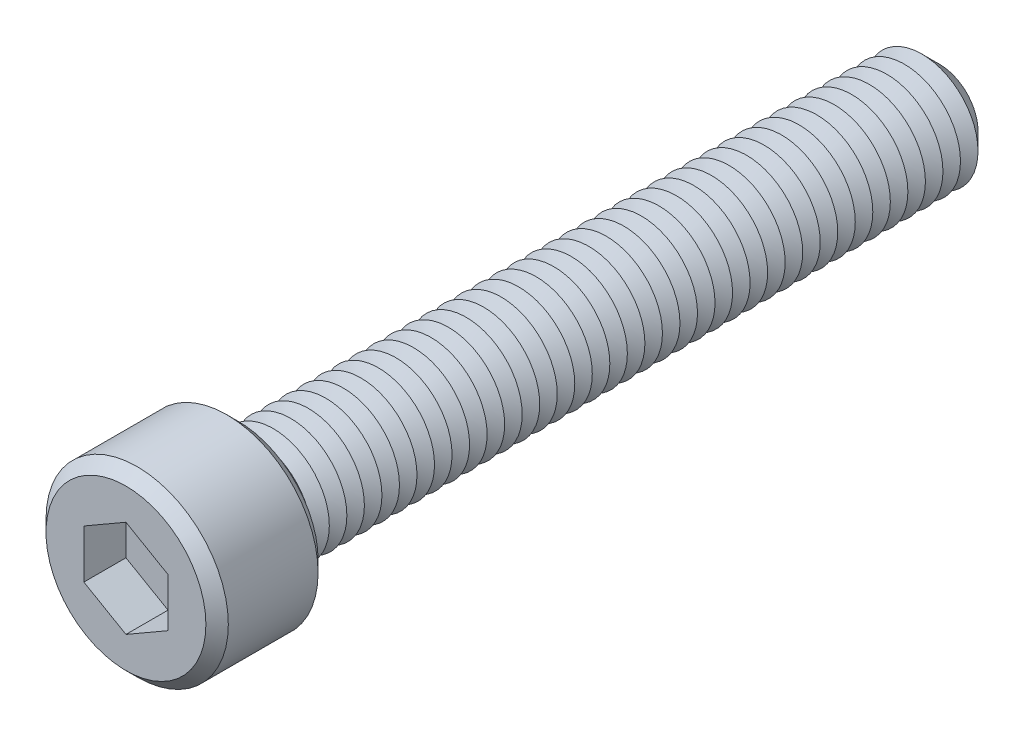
ISO-10303-21;
HEADER;
FILE_DESCRIPTION(('STEP AP214'),'2;1');
FILE_NAME('part.step','',(''),(''),'','','');
FILE_SCHEMA(('AUTOMOTIVE_DESIGN { 1 0 10303 214 1 1 1 1 }'));
ENDSEC;
DATA;
#1=APPLICATION_CONTEXT('core data for automotive mechanical design processes');
#2=APPLICATION_PROTOCOL_DEFINITION('international standard','automotive_design',2000,#1);
#3=PRODUCT_CONTEXT('',#1,'mechanical');
#4=PRODUCT('Part','Part','',(#3));
#5=PRODUCT_RELATED_PRODUCT_CATEGORY('part','',(#4));
#6=PRODUCT_DEFINITION_FORMATION('','',#4);
#7=PRODUCT_DEFINITION_CONTEXT('part definition',#1,'design');
#8=PRODUCT_DEFINITION('design','',#6,#7);
#9=PRODUCT_DEFINITION_SHAPE('','',#8);
#10=(LENGTH_UNIT() NAMED_UNIT(*) SI_UNIT(.MILLI.,.METRE.));
#11=(NAMED_UNIT(*) PLANE_ANGLE_UNIT() SI_UNIT($,.RADIAN.));
#12=(NAMED_UNIT(*) SI_UNIT($,.STERADIAN.) SOLID_ANGLE_UNIT());
#13=UNCERTAINTY_MEASURE_WITH_UNIT(LENGTH_MEASURE(1.E-05),#10,'distance_accuracy_value','');
#14=(GEOMETRIC_REPRESENTATION_CONTEXT(3) GLOBAL_UNCERTAINTY_ASSIGNED_CONTEXT((#13)) GLOBAL_UNIT_ASSIGNED_CONTEXT((#10,
#11,#12)) REPRESENTATION_CONTEXT('',''));
#15=CARTESIAN_POINT('',(0.,0.,0.));
#16=DIRECTION('',(0.,0.,1.));
#17=DIRECTION('',(1.,0.,0.));
#18=AXIS2_PLACEMENT_3D('',#15,#16,#17);
#19=CARTESIAN_POINT('',(0.,0.,8.));
#20=DIRECTION('',(0.,0.,-1.));
#21=DIRECTION('',(-1.,0.,0.));
#22=AXIS2_PLACEMENT_3D('',#19,#20,#21);
#23=CYLINDRICAL_SURFACE('',#22,6.5);
#24=CARTESIAN_POINT('',(0.,0.,0.800000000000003));
#25=DIRECTION('',(0.,0.,1.));
#26=DIRECTION('',(1.,0.,0.));
#27=AXIS2_PLACEMENT_3D('',#24,#25,#26);
#28=CIRCLE('',#27,6.5);
#29=CARTESIAN_POINT('',(6.5,0.,0.800000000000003));
#30=VERTEX_POINT('',#29);
#31=EDGE_CURVE('E488',#30,#30,#28,.T.);
#32=ORIENTED_EDGE('',*,*,#31,.T.);
#33=EDGE_LOOP('',(#32));
#34=FACE_BOUND('',#33,.T.);
#35=CARTESIAN_POINT('',(0.,0.,7.2));
#36=DIRECTION('',(0.,0.,1.));
#37=DIRECTION('',(1.,0.,0.));
#38=AXIS2_PLACEMENT_3D('',#35,#36,#37);
#39=CIRCLE('',#38,6.5);
#40=CARTESIAN_POINT('',(6.5,0.,7.2));
#41=VERTEX_POINT('',#40);
#42=EDGE_CURVE('E484',#41,#41,#39,.F.);
#43=ORIENTED_EDGE('',*,*,#42,.T.);
#44=EDGE_LOOP('',(#43));
#45=FACE_BOUND('',#44,.T.);
#46=ADVANCED_FACE('F39',(#34,#45),#23,.T.);
#47=CARTESIAN_POINT('',(0.,0.,8.));
#48=DIRECTION('',(0.,0.,1.));
#49=DIRECTION('',(1.,0.,0.));
#50=AXIS2_PLACEMENT_3D('',#47,#48,#49);
#51=PLANE('',#50);
#52=CARTESIAN_POINT('',(0.,0.,8.));
#53=DIRECTION('',(0.,0.,1.));
#54=DIRECTION('',(1.,0.,0.));
#55=AXIS2_PLACEMENT_3D('',#52,#53,#54);
#56=CIRCLE('',#55,5.7);
#57=CARTESIAN_POINT('',(5.7,0.,8.));
#58=VERTEX_POINT('',#57);
#59=EDGE_CURVE('E11',#58,#58,#56,.T.);
#60=ORIENTED_EDGE('',*,*,#59,.T.);
#61=EDGE_LOOP('',(#60));
#62=FACE_BOUND('',#61,.T.);
#63=DIRECTION('',(-0.866025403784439,0.5,0.));
#64=VECTOR('',#63,1.);
#65=CARTESIAN_POINT('',(3.,1.73205080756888,8.));
#66=LINE('',#65,#64);
#67=CARTESIAN_POINT('',(3.,1.73205080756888,8.));
#68=VERTEX_POINT('',#67);
#69=CARTESIAN_POINT('',(0.,3.46410161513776,8.));
#70=VERTEX_POINT('',#69);
#71=EDGE_CURVE('E55',#68,#70,#66,.T.);
#72=ORIENTED_EDGE('',*,*,#71,.F.);
#73=DIRECTION('',(0.,1.,0.));
#74=VECTOR('',#73,1.);
#75=CARTESIAN_POINT('',(3.,-1.73205080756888,8.));
#76=LINE('',#75,#74);
#77=CARTESIAN_POINT('',(3.,-1.73205080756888,8.));
#78=VERTEX_POINT('',#77);
#79=EDGE_CURVE('E150',#78,#68,#76,.T.);
#80=ORIENTED_EDGE('',*,*,#79,.F.);
#81=DIRECTION('',(0.866025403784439,0.5,0.));
#82=VECTOR('',#81,1.);
#83=CARTESIAN_POINT('',(0.,-3.46410161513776,8.));
#84=LINE('',#83,#82);
#85=CARTESIAN_POINT('',(0.,-3.46410161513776,8.));
#86=VERTEX_POINT('',#85);
#87=EDGE_CURVE('E147',#86,#78,#84,.T.);
#88=ORIENTED_EDGE('',*,*,#87,.F.);
#89=DIRECTION('',(0.866025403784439,-0.5,0.));
#90=VECTOR('',#89,1.);
#91=CARTESIAN_POINT('',(-3.,-1.73205080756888,8.));
#92=LINE('',#91,#90);
#93=CARTESIAN_POINT('',(-3.,-1.73205080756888,8.));
#94=VERTEX_POINT('',#93);
#95=EDGE_CURVE('E103',#94,#86,#92,.T.);
#96=ORIENTED_EDGE('',*,*,#95,.F.);
#97=DIRECTION('',(0.,-1.,0.));
#98=VECTOR('',#97,1.);
#99=CARTESIAN_POINT('',(-3.,1.73205080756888,8.));
#100=LINE('',#99,#98);
#101=CARTESIAN_POINT('',(-3.,1.73205080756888,8.));
#102=VERTEX_POINT('',#101);
#103=EDGE_CURVE('E141',#102,#94,#100,.T.);
#104=ORIENTED_EDGE('',*,*,#103,.F.);
#105=DIRECTION('',(-0.866025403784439,-0.5,0.));
#106=VECTOR('',#105,1.);
#107=CARTESIAN_POINT('',(0.,3.46410161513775,8.));
#108=LINE('',#107,#106);
#109=EDGE_CURVE('E136',#70,#102,#108,.T.);
#110=ORIENTED_EDGE('',*,*,#109,.F.);
#111=EDGE_LOOP('',(#72,#80,#88,#96,#104,#110));
#112=FACE_BOUND('',#111,.T.);
#113=ADVANCED_FACE('F506',(#62,#112),#51,.T.);
#114=CARTESIAN_POINT('',(0.,0.,0.));
#115=DIRECTION('',(0.,0.,1.));
#116=DIRECTION('',(1.,0.,0.));
#117=AXIS2_PLACEMENT_3D('',#114,#115,#116);
#118=PLANE('',#117);
#119=CARTESIAN_POINT('',(0.,0.,0.));
#120=DIRECTION('',(0.,0.,1.));
#121=DIRECTION('',(1.,0.,0.));
#122=AXIS2_PLACEMENT_3D('',#119,#120,#121);
#123=CIRCLE('',#122,5.7);
#124=CARTESIAN_POINT('',(5.7,0.,0.));
#125=VERTEX_POINT('',#124);
#126=EDGE_CURVE('E48',#125,#125,#123,.F.);
#127=ORIENTED_EDGE('',*,*,#126,.T.);
#128=EDGE_LOOP('',(#127));
#129=FACE_BOUND('',#128,.T.);
#130=CARTESIAN_POINT('',(0.,0.,0.));
#131=DIRECTION('',(0.,0.,1.));
#132=DIRECTION('',(1.,0.,0.));
#133=AXIS2_PLACEMENT_3D('',#130,#131,#132);
#134=CIRCLE('',#133,4.);
#135=CARTESIAN_POINT('',(4.,0.,0.));
#136=VERTEX_POINT('',#135);
#137=EDGE_CURVE('E476',#136,#136,#134,.T.);
#138=ORIENTED_EDGE('',*,*,#137,.T.);
#139=EDGE_LOOP('',(#138));
#140=FACE_BOUND('',#139,.T.);
#141=ADVANCED_FACE('F495',(#129,#140),#118,.F.);
#142=CARTESIAN_POINT('',(0.,0.,0.));
#143=DIRECTION('',(0.,0.,1.));
#144=DIRECTION('',(1.,0.,0.));
#145=AXIS2_PLACEMENT_3D('',#142,#143,#144);
#146=CONICAL_SURFACE('',#145,4.,1.0471975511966);
#147=CARTESIAN_POINT('',(0.,0.,-0.625000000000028));
#148=DIRECTION('',(0.,0.,1.));
#149=DIRECTION('',(1.,0.,0.));
#150=AXIS2_PLACEMENT_3D('',#147,#148,#149);
#151=CIRCLE('',#150,2.91746824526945);
#152=CARTESIAN_POINT('',(2.91746824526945,0.,-0.625000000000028));
#153=VERTEX_POINT('',#152);
#154=EDGE_CURVE('E472',#153,#153,#151,.T.);
#155=ORIENTED_EDGE('',*,*,#154,.T.);
#156=EDGE_LOOP('',(#155));
#157=FACE_BOUND('',#156,.T.);
#158=ORIENTED_EDGE('',*,*,#137,.F.);
#159=EDGE_LOOP('',(#158));
#160=FACE_BOUND('',#159,.T.);
#161=ADVANCED_FACE('F868',(#157,#160),#146,.T.);
#162=CARTESIAN_POINT('',(0.,0.,-0.625000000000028));
#163=DIRECTION('',(0.,0.,-1.));
#164=DIRECTION('',(-1.,0.,0.));
#165=AXIS2_PLACEMENT_3D('',#162,#163,#164);
#166=CONICAL_SURFACE('',#165,2.91746824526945,1.0471975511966);
#167=CARTESIAN_POINT('',(0.,0.,-1.25000000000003));
#168=DIRECTION('',(0.,0.,1.));
#169=DIRECTION('',(1.,0.,0.));
#170=AXIS2_PLACEMENT_3D('',#167,#168,#169);
#171=CIRCLE('',#170,4.);
#172=CARTESIAN_POINT('',(4.,0.,-1.25000000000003));
#173=VERTEX_POINT('',#172);
#174=EDGE_CURVE('E468',#173,#173,#171,.T.);
#175=ORIENTED_EDGE('',*,*,#174,.T.);
#176=EDGE_LOOP('',(#175));
#177=FACE_BOUND('',#176,.T.);
#178=ORIENTED_EDGE('',*,*,#154,.F.);
#179=EDGE_LOOP('',(#178));
#180=FACE_BOUND('',#179,.T.);
#181=ADVANCED_FACE('F864',(#177,#180),#166,.T.);
#182=CARTESIAN_POINT('',(0.,0.,-1.25000000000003));
#183=DIRECTION('',(0.,0.,1.));
#184=DIRECTION('',(1.,0.,0.));
#185=AXIS2_PLACEMENT_3D('',#182,#183,#184);
#186=CONICAL_SURFACE('',#185,4.,1.0471975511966);
#187=CARTESIAN_POINT('',(0.,0.,-1.87500000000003));
#188=DIRECTION('',(0.,0.,1.));
#189=DIRECTION('',(1.,0.,0.));
#190=AXIS2_PLACEMENT_3D('',#187,#188,#189);
#191=CIRCLE('',#190,2.91746824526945);
#192=CARTESIAN_POINT('',(2.91746824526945,0.,-1.87500000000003));
#193=VERTEX_POINT('',#192);
#194=EDGE_CURVE('E464',#193,#193,#191,.T.);
#195=ORIENTED_EDGE('',*,*,#194,.T.);
#196=EDGE_LOOP('',(#195));
#197=FACE_BOUND('',#196,.T.);
#198=ORIENTED_EDGE('',*,*,#174,.F.);
#199=EDGE_LOOP('',(#198));
#200=FACE_BOUND('',#199,.T.);
#201=ADVANCED_FACE('F860',(#197,#200),#186,.T.);
#202=CARTESIAN_POINT('',(0.,0.,-1.87500000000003));
#203=DIRECTION('',(0.,0.,-1.));
#204=DIRECTION('',(-1.,0.,0.));
#205=AXIS2_PLACEMENT_3D('',#202,#203,#204);
#206=CONICAL_SURFACE('',#205,2.91746824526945,1.0471975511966);
#207=CARTESIAN_POINT('',(0.,0.,-2.50000000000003));
#208=DIRECTION('',(0.,0.,1.));
#209=DIRECTION('',(1.,0.,0.));
#210=AXIS2_PLACEMENT_3D('',#207,#208,#209);
#211=CIRCLE('',#210,4.);
#212=CARTESIAN_POINT('',(4.,0.,-2.50000000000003));
#213=VERTEX_POINT('',#212);
#214=EDGE_CURVE('E460',#213,#213,#211,.T.);
#215=ORIENTED_EDGE('',*,*,#214,.T.);
#216=EDGE_LOOP('',(#215));
#217=FACE_BOUND('',#216,.T.);
#218=ORIENTED_EDGE('',*,*,#194,.F.);
#219=EDGE_LOOP('',(#218));
#220=FACE_BOUND('',#219,.T.);
#221=ADVANCED_FACE('F856',(#217,#220),#206,.T.);
#222=CARTESIAN_POINT('',(0.,0.,-2.50000000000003));
#223=DIRECTION('',(0.,0.,1.));
#224=DIRECTION('',(1.,0.,0.));
#225=AXIS2_PLACEMENT_3D('',#222,#223,#224);
#226=CONICAL_SURFACE('',#225,4.,1.0471975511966);
#227=CARTESIAN_POINT('',(0.,0.,-3.12500000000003));
#228=DIRECTION('',(0.,0.,1.));
#229=DIRECTION('',(1.,0.,0.));
#230=AXIS2_PLACEMENT_3D('',#227,#228,#229);
#231=CIRCLE('',#230,2.91746824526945);
#232=CARTESIAN_POINT('',(2.91746824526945,0.,-3.12500000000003));
#233=VERTEX_POINT('',#232);
#234=EDGE_CURVE('E456',#233,#233,#231,.T.);
#235=ORIENTED_EDGE('',*,*,#234,.T.);
#236=EDGE_LOOP('',(#235));
#237=FACE_BOUND('',#236,.T.);
#238=ORIENTED_EDGE('',*,*,#214,.F.);
#239=EDGE_LOOP('',(#238));
#240=FACE_BOUND('',#239,.T.);
#241=ADVANCED_FACE('F852',(#237,#240),#226,.T.);
#242=CARTESIAN_POINT('',(0.,0.,-3.12500000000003));
#243=DIRECTION('',(0.,0.,-1.));
#244=DIRECTION('',(-1.,0.,0.));
#245=AXIS2_PLACEMENT_3D('',#242,#243,#244);
#246=CONICAL_SURFACE('',#245,2.91746824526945,1.0471975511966);
#247=CARTESIAN_POINT('',(0.,0.,-3.75000000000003));
#248=DIRECTION('',(0.,0.,1.));
#249=DIRECTION('',(1.,0.,0.));
#250=AXIS2_PLACEMENT_3D('',#247,#248,#249);
#251=CIRCLE('',#250,4.);
#252=CARTESIAN_POINT('',(4.,0.,-3.75000000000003));
#253=VERTEX_POINT('',#252);
#254=EDGE_CURVE('E452',#253,#253,#251,.T.);
#255=ORIENTED_EDGE('',*,*,#254,.T.);
#256=EDGE_LOOP('',(#255));
#257=FACE_BOUND('',#256,.T.);
#258=ORIENTED_EDGE('',*,*,#234,.F.);
#259=EDGE_LOOP('',(#258));
#260=FACE_BOUND('',#259,.T.);
#261=ADVANCED_FACE('F848',(#257,#260),#246,.T.);
#262=CARTESIAN_POINT('',(0.,0.,-3.75000000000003));
#263=DIRECTION('',(0.,0.,1.));
#264=DIRECTION('',(1.,0.,0.));
#265=AXIS2_PLACEMENT_3D('',#262,#263,#264);
#266=CONICAL_SURFACE('',#265,4.,1.0471975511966);
#267=CARTESIAN_POINT('',(0.,0.,-4.37500000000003));
#268=DIRECTION('',(0.,0.,1.));
#269=DIRECTION('',(1.,0.,0.));
#270=AXIS2_PLACEMENT_3D('',#267,#268,#269);
#271=CIRCLE('',#270,2.91746824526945);
#272=CARTESIAN_POINT('',(2.91746824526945,0.,-4.37500000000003));
#273=VERTEX_POINT('',#272);
#274=EDGE_CURVE('E448',#273,#273,#271,.T.);
#275=ORIENTED_EDGE('',*,*,#274,.T.);
#276=EDGE_LOOP('',(#275));
#277=FACE_BOUND('',#276,.T.);
#278=ORIENTED_EDGE('',*,*,#254,.F.);
#279=EDGE_LOOP('',(#278));
#280=FACE_BOUND('',#279,.T.);
#281=ADVANCED_FACE('F844',(#277,#280),#266,.T.);
#282=CARTESIAN_POINT('',(0.,0.,-4.37500000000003));
#283=DIRECTION('',(0.,0.,-1.));
#284=DIRECTION('',(-1.,0.,0.));
#285=AXIS2_PLACEMENT_3D('',#282,#283,#284);
#286=CONICAL_SURFACE('',#285,2.91746824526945,1.0471975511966);
#287=CARTESIAN_POINT('',(0.,0.,-5.00000000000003));
#288=DIRECTION('',(0.,0.,1.));
#289=DIRECTION('',(1.,0.,0.));
#290=AXIS2_PLACEMENT_3D('',#287,#288,#289);
#291=CIRCLE('',#290,4.);
#292=CARTESIAN_POINT('',(4.,0.,-5.00000000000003));
#293=VERTEX_POINT('',#292);
#294=EDGE_CURVE('E444',#293,#293,#291,.T.);
#295=ORIENTED_EDGE('',*,*,#294,.T.);
#296=EDGE_LOOP('',(#295));
#297=FACE_BOUND('',#296,.T.);
#298=ORIENTED_EDGE('',*,*,#274,.F.);
#299=EDGE_LOOP('',(#298));
#300=FACE_BOUND('',#299,.T.);
#301=ADVANCED_FACE('F840',(#297,#300),#286,.T.);
#302=CARTESIAN_POINT('',(0.,0.,-5.00000000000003));
#303=DIRECTION('',(0.,0.,1.));
#304=DIRECTION('',(1.,0.,0.));
#305=AXIS2_PLACEMENT_3D('',#302,#303,#304);
#306=CONICAL_SURFACE('',#305,4.,1.0471975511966);
#307=CARTESIAN_POINT('',(0.,0.,-5.62500000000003));
#308=DIRECTION('',(0.,0.,1.));
#309=DIRECTION('',(1.,0.,0.));
#310=AXIS2_PLACEMENT_3D('',#307,#308,#309);
#311=CIRCLE('',#310,2.91746824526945);
#312=CARTESIAN_POINT('',(2.91746824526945,0.,-5.62500000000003));
#313=VERTEX_POINT('',#312);
#314=EDGE_CURVE('E440',#313,#313,#311,.T.);
#315=ORIENTED_EDGE('',*,*,#314,.T.);
#316=EDGE_LOOP('',(#315));
#317=FACE_BOUND('',#316,.T.);
#318=ORIENTED_EDGE('',*,*,#294,.F.);
#319=EDGE_LOOP('',(#318));
#320=FACE_BOUND('',#319,.T.);
#321=ADVANCED_FACE('F836',(#317,#320),#306,.T.);
#322=CARTESIAN_POINT('',(0.,0.,-5.62500000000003));
#323=DIRECTION('',(0.,0.,-1.));
#324=DIRECTION('',(-1.,0.,0.));
#325=AXIS2_PLACEMENT_3D('',#322,#323,#324);
#326=CONICAL_SURFACE('',#325,2.91746824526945,1.0471975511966);
#327=CARTESIAN_POINT('',(0.,0.,-6.25000000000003));
#328=DIRECTION('',(0.,0.,1.));
#329=DIRECTION('',(1.,0.,0.));
#330=AXIS2_PLACEMENT_3D('',#327,#328,#329);
#331=CIRCLE('',#330,4.);
#332=CARTESIAN_POINT('',(4.,0.,-6.25000000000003));
#333=VERTEX_POINT('',#332);
#334=EDGE_CURVE('E436',#333,#333,#331,.T.);
#335=ORIENTED_EDGE('',*,*,#334,.T.);
#336=EDGE_LOOP('',(#335));
#337=FACE_BOUND('',#336,.T.);
#338=ORIENTED_EDGE('',*,*,#314,.F.);
#339=EDGE_LOOP('',(#338));
#340=FACE_BOUND('',#339,.T.);
#341=ADVANCED_FACE('F832',(#337,#340),#326,.T.);
#342=CARTESIAN_POINT('',(0.,0.,-6.25000000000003));
#343=DIRECTION('',(0.,0.,1.));
#344=DIRECTION('',(1.,0.,0.));
#345=AXIS2_PLACEMENT_3D('',#342,#343,#344);
#346=CONICAL_SURFACE('',#345,4.,1.0471975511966);
#347=CARTESIAN_POINT('',(0.,0.,-6.87500000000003));
#348=DIRECTION('',(0.,0.,1.));
#349=DIRECTION('',(1.,0.,0.));
#350=AXIS2_PLACEMENT_3D('',#347,#348,#349);
#351=CIRCLE('',#350,2.91746824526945);
#352=CARTESIAN_POINT('',(2.91746824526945,0.,-6.87500000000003));
#353=VERTEX_POINT('',#352);
#354=EDGE_CURVE('E432',#353,#353,#351,.T.);
#355=ORIENTED_EDGE('',*,*,#354,.T.);
#356=EDGE_LOOP('',(#355));
#357=FACE_BOUND('',#356,.T.);
#358=ORIENTED_EDGE('',*,*,#334,.F.);
#359=EDGE_LOOP('',(#358));
#360=FACE_BOUND('',#359,.T.);
#361=ADVANCED_FACE('F828',(#357,#360),#346,.T.);
#362=CARTESIAN_POINT('',(0.,0.,-6.87500000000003));
#363=DIRECTION('',(0.,0.,-1.));
#364=DIRECTION('',(-1.,0.,0.));
#365=AXIS2_PLACEMENT_3D('',#362,#363,#364);
#366=CONICAL_SURFACE('',#365,2.91746824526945,1.0471975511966);
#367=CARTESIAN_POINT('',(0.,0.,-7.50000000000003));
#368=DIRECTION('',(0.,0.,1.));
#369=DIRECTION('',(1.,0.,0.));
#370=AXIS2_PLACEMENT_3D('',#367,#368,#369);
#371=CIRCLE('',#370,4.);
#372=CARTESIAN_POINT('',(4.,0.,-7.50000000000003));
#373=VERTEX_POINT('',#372);
#374=EDGE_CURVE('E428',#373,#373,#371,.T.);
#375=ORIENTED_EDGE('',*,*,#374,.T.);
#376=EDGE_LOOP('',(#375));
#377=FACE_BOUND('',#376,.T.);
#378=ORIENTED_EDGE('',*,*,#354,.F.);
#379=EDGE_LOOP('',(#378));
#380=FACE_BOUND('',#379,.T.);
#381=ADVANCED_FACE('F824',(#377,#380),#366,.T.);
#382=CARTESIAN_POINT('',(0.,0.,-7.50000000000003));
#383=DIRECTION('',(0.,0.,1.));
#384=DIRECTION('',(1.,0.,0.));
#385=AXIS2_PLACEMENT_3D('',#382,#383,#384);
#386=CONICAL_SURFACE('',#385,4.,1.0471975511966);
#387=CARTESIAN_POINT('',(0.,0.,-8.12500000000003));
#388=DIRECTION('',(0.,0.,1.));
#389=DIRECTION('',(1.,0.,0.));
#390=AXIS2_PLACEMENT_3D('',#387,#388,#389);
#391=CIRCLE('',#390,2.91746824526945);
#392=CARTESIAN_POINT('',(2.91746824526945,0.,-8.12500000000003));
#393=VERTEX_POINT('',#392);
#394=EDGE_CURVE('E424',#393,#393,#391,.T.);
#395=ORIENTED_EDGE('',*,*,#394,.T.);
#396=EDGE_LOOP('',(#395));
#397=FACE_BOUND('',#396,.T.);
#398=ORIENTED_EDGE('',*,*,#374,.F.);
#399=EDGE_LOOP('',(#398));
#400=FACE_BOUND('',#399,.T.);
#401=ADVANCED_FACE('F820',(#397,#400),#386,.T.);
#402=CARTESIAN_POINT('',(0.,0.,-8.12500000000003));
#403=DIRECTION('',(0.,0.,-1.));
#404=DIRECTION('',(-1.,0.,0.));
#405=AXIS2_PLACEMENT_3D('',#402,#403,#404);
#406=CONICAL_SURFACE('',#405,2.91746824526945,1.0471975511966);
#407=CARTESIAN_POINT('',(0.,0.,-8.75000000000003));
#408=DIRECTION('',(0.,0.,1.));
#409=DIRECTION('',(1.,0.,0.));
#410=AXIS2_PLACEMENT_3D('',#407,#408,#409);
#411=CIRCLE('',#410,4.);
#412=CARTESIAN_POINT('',(4.,0.,-8.75000000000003));
#413=VERTEX_POINT('',#412);
#414=EDGE_CURVE('E420',#413,#413,#411,.T.);
#415=ORIENTED_EDGE('',*,*,#414,.T.);
#416=EDGE_LOOP('',(#415));
#417=FACE_BOUND('',#416,.T.);
#418=ORIENTED_EDGE('',*,*,#394,.F.);
#419=EDGE_LOOP('',(#418));
#420=FACE_BOUND('',#419,.T.);
#421=ADVANCED_FACE('F816',(#417,#420),#406,.T.);
#422=CARTESIAN_POINT('',(0.,0.,-8.75000000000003));
#423=DIRECTION('',(0.,0.,1.));
#424=DIRECTION('',(1.,0.,0.));
#425=AXIS2_PLACEMENT_3D('',#422,#423,#424);
#426=CONICAL_SURFACE('',#425,4.,1.0471975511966);
#427=CARTESIAN_POINT('',(0.,0.,-9.37500000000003));
#428=DIRECTION('',(0.,0.,1.));
#429=DIRECTION('',(1.,0.,0.));
#430=AXIS2_PLACEMENT_3D('',#427,#428,#429);
#431=CIRCLE('',#430,2.91746824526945);
#432=CARTESIAN_POINT('',(2.91746824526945,0.,-9.37500000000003));
#433=VERTEX_POINT('',#432);
#434=EDGE_CURVE('E416',#433,#433,#431,.T.);
#435=ORIENTED_EDGE('',*,*,#434,.T.);
#436=EDGE_LOOP('',(#435));
#437=FACE_BOUND('',#436,.T.);
#438=ORIENTED_EDGE('',*,*,#414,.F.);
#439=EDGE_LOOP('',(#438));
#440=FACE_BOUND('',#439,.T.);
#441=ADVANCED_FACE('F812',(#437,#440),#426,.T.);
#442=CARTESIAN_POINT('',(0.,0.,-9.37500000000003));
#443=DIRECTION('',(0.,0.,-1.));
#444=DIRECTION('',(-1.,0.,0.));
#445=AXIS2_PLACEMENT_3D('',#442,#443,#444);
#446=CONICAL_SURFACE('',#445,2.91746824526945,1.0471975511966);
#447=CARTESIAN_POINT('',(0.,0.,-10.));
#448=DIRECTION('',(0.,0.,1.));
#449=DIRECTION('',(1.,0.,0.));
#450=AXIS2_PLACEMENT_3D('',#447,#448,#449);
#451=CIRCLE('',#450,4.);
#452=CARTESIAN_POINT('',(4.,0.,-10.));
#453=VERTEX_POINT('',#452);
#454=EDGE_CURVE('E412',#453,#453,#451,.T.);
#455=ORIENTED_EDGE('',*,*,#454,.T.);
#456=EDGE_LOOP('',(#455));
#457=FACE_BOUND('',#456,.T.);
#458=ORIENTED_EDGE('',*,*,#434,.F.);
#459=EDGE_LOOP('',(#458));
#460=FACE_BOUND('',#459,.T.);
#461=ADVANCED_FACE('F808',(#457,#460),#446,.T.);
#462=CARTESIAN_POINT('',(0.,0.,-10.));
#463=DIRECTION('',(0.,0.,1.));
#464=DIRECTION('',(1.,0.,0.));
#465=AXIS2_PLACEMENT_3D('',#462,#463,#464);
#466=CONICAL_SURFACE('',#465,4.,1.0471975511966);
#467=CARTESIAN_POINT('',(0.,0.,-10.625));
#468=DIRECTION('',(0.,0.,1.));
#469=DIRECTION('',(1.,0.,0.));
#470=AXIS2_PLACEMENT_3D('',#467,#468,#469);
#471=CIRCLE('',#470,2.91746824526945);
#472=CARTESIAN_POINT('',(2.91746824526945,0.,-10.625));
#473=VERTEX_POINT('',#472);
#474=EDGE_CURVE('E408',#473,#473,#471,.T.);
#475=ORIENTED_EDGE('',*,*,#474,.T.);
#476=EDGE_LOOP('',(#475));
#477=FACE_BOUND('',#476,.T.);
#478=ORIENTED_EDGE('',*,*,#454,.F.);
#479=EDGE_LOOP('',(#478));
#480=FACE_BOUND('',#479,.T.);
#481=ADVANCED_FACE('F804',(#477,#480),#466,.T.);
#482=CARTESIAN_POINT('',(0.,0.,-10.625));
#483=DIRECTION('',(0.,0.,-1.));
#484=DIRECTION('',(-1.,0.,0.));
#485=AXIS2_PLACEMENT_3D('',#482,#483,#484);
#486=CONICAL_SURFACE('',#485,2.91746824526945,1.0471975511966);
#487=CARTESIAN_POINT('',(0.,0.,-11.25));
#488=DIRECTION('',(0.,0.,1.));
#489=DIRECTION('',(1.,0.,0.));
#490=AXIS2_PLACEMENT_3D('',#487,#488,#489);
#491=CIRCLE('',#490,4.);
#492=CARTESIAN_POINT('',(4.,0.,-11.25));
#493=VERTEX_POINT('',#492);
#494=EDGE_CURVE('E404',#493,#493,#491,.T.);
#495=ORIENTED_EDGE('',*,*,#494,.T.);
#496=EDGE_LOOP('',(#495));
#497=FACE_BOUND('',#496,.T.);
#498=ORIENTED_EDGE('',*,*,#474,.F.);
#499=EDGE_LOOP('',(#498));
#500=FACE_BOUND('',#499,.T.);
#501=ADVANCED_FACE('F800',(#497,#500),#486,.T.);
#502=CARTESIAN_POINT('',(0.,0.,-11.25));
#503=DIRECTION('',(0.,0.,1.));
#504=DIRECTION('',(1.,0.,0.));
#505=AXIS2_PLACEMENT_3D('',#502,#503,#504);
#506=CONICAL_SURFACE('',#505,4.,1.0471975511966);
#507=CARTESIAN_POINT('',(0.,0.,-11.875));
#508=DIRECTION('',(0.,0.,1.));
#509=DIRECTION('',(1.,0.,0.));
#510=AXIS2_PLACEMENT_3D('',#507,#508,#509);
#511=CIRCLE('',#510,2.91746824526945);
#512=CARTESIAN_POINT('',(2.91746824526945,0.,-11.875));
#513=VERTEX_POINT('',#512);
#514=EDGE_CURVE('E400',#513,#513,#511,.T.);
#515=ORIENTED_EDGE('',*,*,#514,.T.);
#516=EDGE_LOOP('',(#515));
#517=FACE_BOUND('',#516,.T.);
#518=ORIENTED_EDGE('',*,*,#494,.F.);
#519=EDGE_LOOP('',(#518));
#520=FACE_BOUND('',#519,.T.);
#521=ADVANCED_FACE('F796',(#517,#520),#506,.T.);
#522=CARTESIAN_POINT('',(0.,0.,-11.875));
#523=DIRECTION('',(0.,0.,-1.));
#524=DIRECTION('',(-1.,0.,0.));
#525=AXIS2_PLACEMENT_3D('',#522,#523,#524);
#526=CONICAL_SURFACE('',#525,2.91746824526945,1.0471975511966);
#527=CARTESIAN_POINT('',(0.,0.,-12.5));
#528=DIRECTION('',(0.,0.,1.));
#529=DIRECTION('',(1.,0.,0.));
#530=AXIS2_PLACEMENT_3D('',#527,#528,#529);
#531=CIRCLE('',#530,4.);
#532=CARTESIAN_POINT('',(4.,0.,-12.5));
#533=VERTEX_POINT('',#532);
#534=EDGE_CURVE('E396',#533,#533,#531,.T.);
#535=ORIENTED_EDGE('',*,*,#534,.T.);
#536=EDGE_LOOP('',(#535));
#537=FACE_BOUND('',#536,.T.);
#538=ORIENTED_EDGE('',*,*,#514,.F.);
#539=EDGE_LOOP('',(#538));
#540=FACE_BOUND('',#539,.T.);
#541=ADVANCED_FACE('F792',(#537,#540),#526,.T.);
#542=CARTESIAN_POINT('',(0.,0.,-12.5));
#543=DIRECTION('',(0.,0.,1.));
#544=DIRECTION('',(1.,0.,0.));
#545=AXIS2_PLACEMENT_3D('',#542,#543,#544);
#546=CONICAL_SURFACE('',#545,4.,1.0471975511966);
#547=CARTESIAN_POINT('',(0.,0.,-13.125));
#548=DIRECTION('',(0.,0.,1.));
#549=DIRECTION('',(1.,0.,0.));
#550=AXIS2_PLACEMENT_3D('',#547,#548,#549);
#551=CIRCLE('',#550,2.91746824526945);
#552=CARTESIAN_POINT('',(2.91746824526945,0.,-13.125));
#553=VERTEX_POINT('',#552);
#554=EDGE_CURVE('E392',#553,#553,#551,.T.);
#555=ORIENTED_EDGE('',*,*,#554,.T.);
#556=EDGE_LOOP('',(#555));
#557=FACE_BOUND('',#556,.T.);
#558=ORIENTED_EDGE('',*,*,#534,.F.);
#559=EDGE_LOOP('',(#558));
#560=FACE_BOUND('',#559,.T.);
#561=ADVANCED_FACE('F788',(#557,#560),#546,.T.);
#562=CARTESIAN_POINT('',(0.,0.,-13.125));
#563=DIRECTION('',(0.,0.,-1.));
#564=DIRECTION('',(-1.,0.,0.));
#565=AXIS2_PLACEMENT_3D('',#562,#563,#564);
#566=CONICAL_SURFACE('',#565,2.91746824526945,1.0471975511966);
#567=CARTESIAN_POINT('',(0.,0.,-13.75));
#568=DIRECTION('',(0.,0.,1.));
#569=DIRECTION('',(1.,0.,0.));
#570=AXIS2_PLACEMENT_3D('',#567,#568,#569);
#571=CIRCLE('',#570,4.);
#572=CARTESIAN_POINT('',(4.,0.,-13.75));
#573=VERTEX_POINT('',#572);
#574=EDGE_CURVE('E388',#573,#573,#571,.T.);
#575=ORIENTED_EDGE('',*,*,#574,.T.);
#576=EDGE_LOOP('',(#575));
#577=FACE_BOUND('',#576,.T.);
#578=ORIENTED_EDGE('',*,*,#554,.F.);
#579=EDGE_LOOP('',(#578));
#580=FACE_BOUND('',#579,.T.);
#581=ADVANCED_FACE('F784',(#577,#580),#566,.T.);
#582=CARTESIAN_POINT('',(0.,0.,-13.75));
#583=DIRECTION('',(0.,0.,1.));
#584=DIRECTION('',(1.,0.,0.));
#585=AXIS2_PLACEMENT_3D('',#582,#583,#584);
#586=CONICAL_SURFACE('',#585,4.,1.0471975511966);
#587=CARTESIAN_POINT('',(0.,0.,-14.375));
#588=DIRECTION('',(0.,0.,1.));
#589=DIRECTION('',(1.,0.,0.));
#590=AXIS2_PLACEMENT_3D('',#587,#588,#589);
#591=CIRCLE('',#590,2.91746824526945);
#592=CARTESIAN_POINT('',(2.91746824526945,0.,-14.375));
#593=VERTEX_POINT('',#592);
#594=EDGE_CURVE('E384',#593,#593,#591,.T.);
#595=ORIENTED_EDGE('',*,*,#594,.T.);
#596=EDGE_LOOP('',(#595));
#597=FACE_BOUND('',#596,.T.);
#598=ORIENTED_EDGE('',*,*,#574,.F.);
#599=EDGE_LOOP('',(#598));
#600=FACE_BOUND('',#599,.T.);
#601=ADVANCED_FACE('F780',(#597,#600),#586,.T.);
#602=CARTESIAN_POINT('',(0.,0.,-14.375));
#603=DIRECTION('',(0.,0.,-1.));
#604=DIRECTION('',(-1.,0.,0.));
#605=AXIS2_PLACEMENT_3D('',#602,#603,#604);
#606=CONICAL_SURFACE('',#605,2.91746824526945,1.0471975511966);
#607=CARTESIAN_POINT('',(0.,0.,-15.));
#608=DIRECTION('',(0.,0.,1.));
#609=DIRECTION('',(1.,0.,0.));
#610=AXIS2_PLACEMENT_3D('',#607,#608,#609);
#611=CIRCLE('',#610,4.);
#612=CARTESIAN_POINT('',(4.,0.,-15.));
#613=VERTEX_POINT('',#612);
#614=EDGE_CURVE('E380',#613,#613,#611,.T.);
#615=ORIENTED_EDGE('',*,*,#614,.T.);
#616=EDGE_LOOP('',(#615));
#617=FACE_BOUND('',#616,.T.);
#618=ORIENTED_EDGE('',*,*,#594,.F.);
#619=EDGE_LOOP('',(#618));
#620=FACE_BOUND('',#619,.T.);
#621=ADVANCED_FACE('F776',(#617,#620),#606,.T.);
#622=CARTESIAN_POINT('',(0.,0.,-15.));
#623=DIRECTION('',(0.,0.,1.));
#624=DIRECTION('',(1.,0.,0.));
#625=AXIS2_PLACEMENT_3D('',#622,#623,#624);
#626=CONICAL_SURFACE('',#625,4.,1.0471975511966);
#627=CARTESIAN_POINT('',(0.,0.,-15.625));
#628=DIRECTION('',(0.,0.,1.));
#629=DIRECTION('',(1.,0.,0.));
#630=AXIS2_PLACEMENT_3D('',#627,#628,#629);
#631=CIRCLE('',#630,2.91746824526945);
#632=CARTESIAN_POINT('',(2.91746824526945,0.,-15.625));
#633=VERTEX_POINT('',#632);
#634=EDGE_CURVE('E376',#633,#633,#631,.T.);
#635=ORIENTED_EDGE('',*,*,#634,.T.);
#636=EDGE_LOOP('',(#635));
#637=FACE_BOUND('',#636,.T.);
#638=ORIENTED_EDGE('',*,*,#614,.F.);
#639=EDGE_LOOP('',(#638));
#640=FACE_BOUND('',#639,.T.);
#641=ADVANCED_FACE('F772',(#637,#640),#626,.T.);
#642=CARTESIAN_POINT('',(0.,0.,-15.625));
#643=DIRECTION('',(0.,0.,-1.));
#644=DIRECTION('',(-1.,0.,0.));
#645=AXIS2_PLACEMENT_3D('',#642,#643,#644);
#646=CONICAL_SURFACE('',#645,2.91746824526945,1.0471975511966);
#647=CARTESIAN_POINT('',(0.,0.,-16.25));
#648=DIRECTION('',(0.,0.,1.));
#649=DIRECTION('',(1.,0.,0.));
#650=AXIS2_PLACEMENT_3D('',#647,#648,#649);
#651=CIRCLE('',#650,4.);
#652=CARTESIAN_POINT('',(4.,0.,-16.25));
#653=VERTEX_POINT('',#652);
#654=EDGE_CURVE('E372',#653,#653,#651,.T.);
#655=ORIENTED_EDGE('',*,*,#654,.T.);
#656=EDGE_LOOP('',(#655));
#657=FACE_BOUND('',#656,.T.);
#658=ORIENTED_EDGE('',*,*,#634,.F.);
#659=EDGE_LOOP('',(#658));
#660=FACE_BOUND('',#659,.T.);
#661=ADVANCED_FACE('F768',(#657,#660),#646,.T.);
#662=CARTESIAN_POINT('',(0.,0.,-16.25));
#663=DIRECTION('',(0.,0.,1.));
#664=DIRECTION('',(1.,0.,0.));
#665=AXIS2_PLACEMENT_3D('',#662,#663,#664);
#666=CONICAL_SURFACE('',#665,4.,1.0471975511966);
#667=CARTESIAN_POINT('',(0.,0.,-16.875));
#668=DIRECTION('',(0.,0.,1.));
#669=DIRECTION('',(1.,0.,0.));
#670=AXIS2_PLACEMENT_3D('',#667,#668,#669);
#671=CIRCLE('',#670,2.91746824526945);
#672=CARTESIAN_POINT('',(2.91746824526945,0.,-16.875));
#673=VERTEX_POINT('',#672);
#674=EDGE_CURVE('E368',#673,#673,#671,.T.);
#675=ORIENTED_EDGE('',*,*,#674,.T.);
#676=EDGE_LOOP('',(#675));
#677=FACE_BOUND('',#676,.T.);
#678=ORIENTED_EDGE('',*,*,#654,.F.);
#679=EDGE_LOOP('',(#678));
#680=FACE_BOUND('',#679,.T.);
#681=ADVANCED_FACE('F764',(#677,#680),#666,.T.);
#682=CARTESIAN_POINT('',(0.,0.,-16.875));
#683=DIRECTION('',(0.,0.,-1.));
#684=DIRECTION('',(-1.,0.,0.));
#685=AXIS2_PLACEMENT_3D('',#682,#683,#684);
#686=CONICAL_SURFACE('',#685,2.91746824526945,1.0471975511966);
#687=CARTESIAN_POINT('',(0.,0.,-17.5));
#688=DIRECTION('',(0.,0.,1.));
#689=DIRECTION('',(1.,0.,0.));
#690=AXIS2_PLACEMENT_3D('',#687,#688,#689);
#691=CIRCLE('',#690,4.);
#692=CARTESIAN_POINT('',(4.,0.,-17.5));
#693=VERTEX_POINT('',#692);
#694=EDGE_CURVE('E364',#693,#693,#691,.T.);
#695=ORIENTED_EDGE('',*,*,#694,.T.);
#696=EDGE_LOOP('',(#695));
#697=FACE_BOUND('',#696,.T.);
#698=ORIENTED_EDGE('',*,*,#674,.F.);
#699=EDGE_LOOP('',(#698));
#700=FACE_BOUND('',#699,.T.);
#701=ADVANCED_FACE('F760',(#697,#700),#686,.T.);
#702=CARTESIAN_POINT('',(0.,0.,-17.5));
#703=DIRECTION('',(0.,0.,1.));
#704=DIRECTION('',(1.,0.,0.));
#705=AXIS2_PLACEMENT_3D('',#702,#703,#704);
#706=CONICAL_SURFACE('',#705,4.,1.0471975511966);
#707=CARTESIAN_POINT('',(0.,0.,-18.125));
#708=DIRECTION('',(0.,0.,1.));
#709=DIRECTION('',(1.,0.,0.));
#710=AXIS2_PLACEMENT_3D('',#707,#708,#709);
#711=CIRCLE('',#710,2.91746824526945);
#712=CARTESIAN_POINT('',(2.91746824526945,0.,-18.125));
#713=VERTEX_POINT('',#712);
#714=EDGE_CURVE('E360',#713,#713,#711,.T.);
#715=ORIENTED_EDGE('',*,*,#714,.T.);
#716=EDGE_LOOP('',(#715));
#717=FACE_BOUND('',#716,.T.);
#718=ORIENTED_EDGE('',*,*,#694,.F.);
#719=EDGE_LOOP('',(#718));
#720=FACE_BOUND('',#719,.T.);
#721=ADVANCED_FACE('F756',(#717,#720),#706,.T.);
#722=CARTESIAN_POINT('',(0.,0.,-18.125));
#723=DIRECTION('',(0.,0.,-1.));
#724=DIRECTION('',(-1.,0.,0.));
#725=AXIS2_PLACEMENT_3D('',#722,#723,#724);
#726=CONICAL_SURFACE('',#725,2.91746824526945,1.0471975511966);
#727=CARTESIAN_POINT('',(0.,0.,-18.75));
#728=DIRECTION('',(0.,0.,1.));
#729=DIRECTION('',(1.,0.,0.));
#730=AXIS2_PLACEMENT_3D('',#727,#728,#729);
#731=CIRCLE('',#730,4.);
#732=CARTESIAN_POINT('',(4.,0.,-18.75));
#733=VERTEX_POINT('',#732);
#734=EDGE_CURVE('E356',#733,#733,#731,.T.);
#735=ORIENTED_EDGE('',*,*,#734,.T.);
#736=EDGE_LOOP('',(#735));
#737=FACE_BOUND('',#736,.T.);
#738=ORIENTED_EDGE('',*,*,#714,.F.);
#739=EDGE_LOOP('',(#738));
#740=FACE_BOUND('',#739,.T.);
#741=ADVANCED_FACE('F752',(#737,#740),#726,.T.);
#742=CARTESIAN_POINT('',(0.,0.,-18.75));
#743=DIRECTION('',(0.,0.,1.));
#744=DIRECTION('',(1.,0.,0.));
#745=AXIS2_PLACEMENT_3D('',#742,#743,#744);
#746=CONICAL_SURFACE('',#745,4.,1.0471975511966);
#747=CARTESIAN_POINT('',(0.,0.,-19.375));
#748=DIRECTION('',(0.,0.,1.));
#749=DIRECTION('',(1.,0.,0.));
#750=AXIS2_PLACEMENT_3D('',#747,#748,#749);
#751=CIRCLE('',#750,2.91746824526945);
#752=CARTESIAN_POINT('',(2.91746824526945,0.,-19.375));
#753=VERTEX_POINT('',#752);
#754=EDGE_CURVE('E352',#753,#753,#751,.T.);
#755=ORIENTED_EDGE('',*,*,#754,.T.);
#756=EDGE_LOOP('',(#755));
#757=FACE_BOUND('',#756,.T.);
#758=ORIENTED_EDGE('',*,*,#734,.F.);
#759=EDGE_LOOP('',(#758));
#760=FACE_BOUND('',#759,.T.);
#761=ADVANCED_FACE('F748',(#757,#760),#746,.T.);
#762=CARTESIAN_POINT('',(0.,0.,-19.375));
#763=DIRECTION('',(0.,0.,-1.));
#764=DIRECTION('',(-1.,0.,0.));
#765=AXIS2_PLACEMENT_3D('',#762,#763,#764);
#766=CONICAL_SURFACE('',#765,2.91746824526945,1.0471975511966);
#767=CARTESIAN_POINT('',(0.,0.,-20.));
#768=DIRECTION('',(0.,0.,1.));
#769=DIRECTION('',(1.,0.,0.));
#770=AXIS2_PLACEMENT_3D('',#767,#768,#769);
#771=CIRCLE('',#770,4.);
#772=CARTESIAN_POINT('',(4.,0.,-20.));
#773=VERTEX_POINT('',#772);
#774=EDGE_CURVE('E348',#773,#773,#771,.T.);
#775=ORIENTED_EDGE('',*,*,#774,.T.);
#776=EDGE_LOOP('',(#775));
#777=FACE_BOUND('',#776,.T.);
#778=ORIENTED_EDGE('',*,*,#754,.F.);
#779=EDGE_LOOP('',(#778));
#780=FACE_BOUND('',#779,.T.);
#781=ADVANCED_FACE('F744',(#777,#780),#766,.T.);
#782=CARTESIAN_POINT('',(0.,0.,-20.));
#783=DIRECTION('',(0.,0.,1.));
#784=DIRECTION('',(1.,0.,0.));
#785=AXIS2_PLACEMENT_3D('',#782,#783,#784);
#786=CONICAL_SURFACE('',#785,4.,1.0471975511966);
#787=CARTESIAN_POINT('',(0.,0.,-20.625));
#788=DIRECTION('',(0.,0.,1.));
#789=DIRECTION('',(1.,0.,0.));
#790=AXIS2_PLACEMENT_3D('',#787,#788,#789);
#791=CIRCLE('',#790,2.91746824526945);
#792=CARTESIAN_POINT('',(2.91746824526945,0.,-20.625));
#793=VERTEX_POINT('',#792);
#794=EDGE_CURVE('E344',#793,#793,#791,.T.);
#795=ORIENTED_EDGE('',*,*,#794,.T.);
#796=EDGE_LOOP('',(#795));
#797=FACE_BOUND('',#796,.T.);
#798=ORIENTED_EDGE('',*,*,#774,.F.);
#799=EDGE_LOOP('',(#798));
#800=FACE_BOUND('',#799,.T.);
#801=ADVANCED_FACE('F740',(#797,#800),#786,.T.);
#802=CARTESIAN_POINT('',(0.,0.,-20.625));
#803=DIRECTION('',(0.,0.,-1.));
#804=DIRECTION('',(-1.,0.,0.));
#805=AXIS2_PLACEMENT_3D('',#802,#803,#804);
#806=CONICAL_SURFACE('',#805,2.91746824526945,1.0471975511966);
#807=CARTESIAN_POINT('',(0.,0.,-21.25));
#808=DIRECTION('',(0.,0.,1.));
#809=DIRECTION('',(1.,0.,0.));
#810=AXIS2_PLACEMENT_3D('',#807,#808,#809);
#811=CIRCLE('',#810,4.);
#812=CARTESIAN_POINT('',(4.,0.,-21.25));
#813=VERTEX_POINT('',#812);
#814=EDGE_CURVE('E340',#813,#813,#811,.T.);
#815=ORIENTED_EDGE('',*,*,#814,.T.);
#816=EDGE_LOOP('',(#815));
#817=FACE_BOUND('',#816,.T.);
#818=ORIENTED_EDGE('',*,*,#794,.F.);
#819=EDGE_LOOP('',(#818));
#820=FACE_BOUND('',#819,.T.);
#821=ADVANCED_FACE('F736',(#817,#820),#806,.T.);
#822=CARTESIAN_POINT('',(0.,0.,-21.25));
#823=DIRECTION('',(0.,0.,1.));
#824=DIRECTION('',(1.,0.,0.));
#825=AXIS2_PLACEMENT_3D('',#822,#823,#824);
#826=CONICAL_SURFACE('',#825,4.,1.0471975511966);
#827=CARTESIAN_POINT('',(0.,0.,-21.875));
#828=DIRECTION('',(0.,0.,1.));
#829=DIRECTION('',(1.,0.,0.));
#830=AXIS2_PLACEMENT_3D('',#827,#828,#829);
#831=CIRCLE('',#830,2.91746824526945);
#832=CARTESIAN_POINT('',(2.91746824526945,0.,-21.875));
#833=VERTEX_POINT('',#832);
#834=EDGE_CURVE('E336',#833,#833,#831,.T.);
#835=ORIENTED_EDGE('',*,*,#834,.T.);
#836=EDGE_LOOP('',(#835));
#837=FACE_BOUND('',#836,.T.);
#838=ORIENTED_EDGE('',*,*,#814,.F.);
#839=EDGE_LOOP('',(#838));
#840=FACE_BOUND('',#839,.T.);
#841=ADVANCED_FACE('F732',(#837,#840),#826,.T.);
#842=CARTESIAN_POINT('',(0.,0.,-21.875));
#843=DIRECTION('',(0.,0.,-1.));
#844=DIRECTION('',(-1.,0.,0.));
#845=AXIS2_PLACEMENT_3D('',#842,#843,#844);
#846=CONICAL_SURFACE('',#845,2.91746824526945,1.0471975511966);
#847=CARTESIAN_POINT('',(0.,0.,-22.5));
#848=DIRECTION('',(0.,0.,1.));
#849=DIRECTION('',(1.,0.,0.));
#850=AXIS2_PLACEMENT_3D('',#847,#848,#849);
#851=CIRCLE('',#850,4.);
#852=CARTESIAN_POINT('',(4.,0.,-22.5));
#853=VERTEX_POINT('',#852);
#854=EDGE_CURVE('E332',#853,#853,#851,.T.);
#855=ORIENTED_EDGE('',*,*,#854,.T.);
#856=EDGE_LOOP('',(#855));
#857=FACE_BOUND('',#856,.T.);
#858=ORIENTED_EDGE('',*,*,#834,.F.);
#859=EDGE_LOOP('',(#858));
#860=FACE_BOUND('',#859,.T.);
#861=ADVANCED_FACE('F728',(#857,#860),#846,.T.);
#862=CARTESIAN_POINT('',(0.,0.,-22.5));
#863=DIRECTION('',(0.,0.,1.));
#864=DIRECTION('',(1.,0.,0.));
#865=AXIS2_PLACEMENT_3D('',#862,#863,#864);
#866=CONICAL_SURFACE('',#865,4.,1.0471975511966);
#867=CARTESIAN_POINT('',(0.,0.,-23.125));
#868=DIRECTION('',(0.,0.,1.));
#869=DIRECTION('',(1.,0.,0.));
#870=AXIS2_PLACEMENT_3D('',#867,#868,#869);
#871=CIRCLE('',#870,2.91746824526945);
#872=CARTESIAN_POINT('',(2.91746824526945,0.,-23.125));
#873=VERTEX_POINT('',#872);
#874=EDGE_CURVE('E328',#873,#873,#871,.T.);
#875=ORIENTED_EDGE('',*,*,#874,.T.);
#876=EDGE_LOOP('',(#875));
#877=FACE_BOUND('',#876,.T.);
#878=ORIENTED_EDGE('',*,*,#854,.F.);
#879=EDGE_LOOP('',(#878));
#880=FACE_BOUND('',#879,.T.);
#881=ADVANCED_FACE('F724',(#877,#880),#866,.T.);
#882=CARTESIAN_POINT('',(0.,0.,-23.125));
#883=DIRECTION('',(0.,0.,-1.));
#884=DIRECTION('',(-1.,0.,0.));
#885=AXIS2_PLACEMENT_3D('',#882,#883,#884);
#886=CONICAL_SURFACE('',#885,2.91746824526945,1.0471975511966);
#887=CARTESIAN_POINT('',(0.,0.,-23.75));
#888=DIRECTION('',(0.,0.,1.));
#889=DIRECTION('',(1.,0.,0.));
#890=AXIS2_PLACEMENT_3D('',#887,#888,#889);
#891=CIRCLE('',#890,4.);
#892=CARTESIAN_POINT('',(4.,0.,-23.75));
#893=VERTEX_POINT('',#892);
#894=EDGE_CURVE('E324',#893,#893,#891,.T.);
#895=ORIENTED_EDGE('',*,*,#894,.T.);
#896=EDGE_LOOP('',(#895));
#897=FACE_BOUND('',#896,.T.);
#898=ORIENTED_EDGE('',*,*,#874,.F.);
#899=EDGE_LOOP('',(#898));
#900=FACE_BOUND('',#899,.T.);
#901=ADVANCED_FACE('F720',(#897,#900),#886,.T.);
#902=CARTESIAN_POINT('',(0.,0.,-23.75));
#903=DIRECTION('',(0.,0.,1.));
#904=DIRECTION('',(1.,0.,0.));
#905=AXIS2_PLACEMENT_3D('',#902,#903,#904);
#906=CONICAL_SURFACE('',#905,4.,1.0471975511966);
#907=CARTESIAN_POINT('',(0.,0.,-24.375));
#908=DIRECTION('',(0.,0.,1.));
#909=DIRECTION('',(1.,0.,0.));
#910=AXIS2_PLACEMENT_3D('',#907,#908,#909);
#911=CIRCLE('',#910,2.91746824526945);
#912=CARTESIAN_POINT('',(2.91746824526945,0.,-24.375));
#913=VERTEX_POINT('',#912);
#914=EDGE_CURVE('E320',#913,#913,#911,.T.);
#915=ORIENTED_EDGE('',*,*,#914,.T.);
#916=EDGE_LOOP('',(#915));
#917=FACE_BOUND('',#916,.T.);
#918=ORIENTED_EDGE('',*,*,#894,.F.);
#919=EDGE_LOOP('',(#918));
#920=FACE_BOUND('',#919,.T.);
#921=ADVANCED_FACE('F716',(#917,#920),#906,.T.);
#922=CARTESIAN_POINT('',(0.,0.,-24.375));
#923=DIRECTION('',(0.,0.,-1.));
#924=DIRECTION('',(-1.,0.,0.));
#925=AXIS2_PLACEMENT_3D('',#922,#923,#924);
#926=CONICAL_SURFACE('',#925,2.91746824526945,1.0471975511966);
#927=CARTESIAN_POINT('',(0.,0.,-25.));
#928=DIRECTION('',(0.,0.,1.));
#929=DIRECTION('',(1.,0.,0.));
#930=AXIS2_PLACEMENT_3D('',#927,#928,#929);
#931=CIRCLE('',#930,4.);
#932=CARTESIAN_POINT('',(4.,0.,-25.));
#933=VERTEX_POINT('',#932);
#934=EDGE_CURVE('E316',#933,#933,#931,.T.);
#935=ORIENTED_EDGE('',*,*,#934,.T.);
#936=EDGE_LOOP('',(#935));
#937=FACE_BOUND('',#936,.T.);
#938=ORIENTED_EDGE('',*,*,#914,.F.);
#939=EDGE_LOOP('',(#938));
#940=FACE_BOUND('',#939,.T.);
#941=ADVANCED_FACE('F712',(#937,#940),#926,.T.);
#942=CARTESIAN_POINT('',(0.,0.,-25.));
#943=DIRECTION('',(0.,0.,1.));
#944=DIRECTION('',(1.,0.,0.));
#945=AXIS2_PLACEMENT_3D('',#942,#943,#944);
#946=CONICAL_SURFACE('',#945,4.,1.0471975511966);
#947=CARTESIAN_POINT('',(0.,0.,-25.625));
#948=DIRECTION('',(0.,0.,1.));
#949=DIRECTION('',(1.,0.,0.));
#950=AXIS2_PLACEMENT_3D('',#947,#948,#949);
#951=CIRCLE('',#950,2.91746824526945);
#952=CARTESIAN_POINT('',(2.91746824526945,0.,-25.625));
#953=VERTEX_POINT('',#952);
#954=EDGE_CURVE('E312',#953,#953,#951,.T.);
#955=ORIENTED_EDGE('',*,*,#954,.T.);
#956=EDGE_LOOP('',(#955));
#957=FACE_BOUND('',#956,.T.);
#958=ORIENTED_EDGE('',*,*,#934,.F.);
#959=EDGE_LOOP('',(#958));
#960=FACE_BOUND('',#959,.T.);
#961=ADVANCED_FACE('F708',(#957,#960),#946,.T.);
#962=CARTESIAN_POINT('',(0.,0.,-25.625));
#963=DIRECTION('',(0.,0.,-1.));
#964=DIRECTION('',(-1.,0.,0.));
#965=AXIS2_PLACEMENT_3D('',#962,#963,#964);
#966=CONICAL_SURFACE('',#965,2.91746824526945,1.0471975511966);
#967=CARTESIAN_POINT('',(0.,0.,-26.25));
#968=DIRECTION('',(0.,0.,1.));
#969=DIRECTION('',(1.,0.,0.));
#970=AXIS2_PLACEMENT_3D('',#967,#968,#969);
#971=CIRCLE('',#970,4.);
#972=CARTESIAN_POINT('',(4.,0.,-26.25));
#973=VERTEX_POINT('',#972);
#974=EDGE_CURVE('E308',#973,#973,#971,.T.);
#975=ORIENTED_EDGE('',*,*,#974,.T.);
#976=EDGE_LOOP('',(#975));
#977=FACE_BOUND('',#976,.T.);
#978=ORIENTED_EDGE('',*,*,#954,.F.);
#979=EDGE_LOOP('',(#978));
#980=FACE_BOUND('',#979,.T.);
#981=ADVANCED_FACE('F704',(#977,#980),#966,.T.);
#982=CARTESIAN_POINT('',(0.,0.,-26.25));
#983=DIRECTION('',(0.,0.,1.));
#984=DIRECTION('',(1.,0.,0.));
#985=AXIS2_PLACEMENT_3D('',#982,#983,#984);
#986=CONICAL_SURFACE('',#985,4.,1.0471975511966);
#987=CARTESIAN_POINT('',(0.,0.,-26.875));
#988=DIRECTION('',(0.,0.,1.));
#989=DIRECTION('',(1.,0.,0.));
#990=AXIS2_PLACEMENT_3D('',#987,#988,#989);
#991=CIRCLE('',#990,2.91746824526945);
#992=CARTESIAN_POINT('',(2.91746824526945,0.,-26.875));
#993=VERTEX_POINT('',#992);
#994=EDGE_CURVE('E304',#993,#993,#991,.T.);
#995=ORIENTED_EDGE('',*,*,#994,.T.);
#996=EDGE_LOOP('',(#995));
#997=FACE_BOUND('',#996,.T.);
#998=ORIENTED_EDGE('',*,*,#974,.F.);
#999=EDGE_LOOP('',(#998));
#1000=FACE_BOUND('',#999,.T.);
#1001=ADVANCED_FACE('F700',(#997,#1000),#986,.T.);
#1002=CARTESIAN_POINT('',(0.,0.,-26.875));
#1003=DIRECTION('',(0.,0.,-1.));
#1004=DIRECTION('',(-1.,0.,0.));
#1005=AXIS2_PLACEMENT_3D('',#1002,#1003,#1004);
#1006=CONICAL_SURFACE('',#1005,2.91746824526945,1.0471975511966);
#1007=CARTESIAN_POINT('',(0.,0.,-27.5));
#1008=DIRECTION('',(0.,0.,1.));
#1009=DIRECTION('',(1.,0.,0.));
#1010=AXIS2_PLACEMENT_3D('',#1007,#1008,#1009);
#1011=CIRCLE('',#1010,4.);
#1012=CARTESIAN_POINT('',(4.,0.,-27.5));
#1013=VERTEX_POINT('',#1012);
#1014=EDGE_CURVE('E300',#1013,#1013,#1011,.T.);
#1015=ORIENTED_EDGE('',*,*,#1014,.T.);
#1016=EDGE_LOOP('',(#1015));
#1017=FACE_BOUND('',#1016,.T.);
#1018=ORIENTED_EDGE('',*,*,#994,.F.);
#1019=EDGE_LOOP('',(#1018));
#1020=FACE_BOUND('',#1019,.T.);
#1021=ADVANCED_FACE('F696',(#1017,#1020),#1006,.T.);
#1022=CARTESIAN_POINT('',(0.,0.,-27.5));
#1023=DIRECTION('',(0.,0.,1.));
#1024=DIRECTION('',(1.,0.,0.));
#1025=AXIS2_PLACEMENT_3D('',#1022,#1023,#1024);
#1026=CONICAL_SURFACE('',#1025,4.,1.0471975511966);
#1027=CARTESIAN_POINT('',(0.,0.,-28.125));
#1028=DIRECTION('',(0.,0.,1.));
#1029=DIRECTION('',(1.,0.,0.));
#1030=AXIS2_PLACEMENT_3D('',#1027,#1028,#1029);
#1031=CIRCLE('',#1030,2.91746824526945);
#1032=CARTESIAN_POINT('',(2.91746824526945,0.,-28.125));
#1033=VERTEX_POINT('',#1032);
#1034=EDGE_CURVE('E296',#1033,#1033,#1031,.T.);
#1035=ORIENTED_EDGE('',*,*,#1034,.T.);
#1036=EDGE_LOOP('',(#1035));
#1037=FACE_BOUND('',#1036,.T.);
#1038=ORIENTED_EDGE('',*,*,#1014,.F.);
#1039=EDGE_LOOP('',(#1038));
#1040=FACE_BOUND('',#1039,.T.);
#1041=ADVANCED_FACE('F692',(#1037,#1040),#1026,.T.);
#1042=CARTESIAN_POINT('',(0.,0.,-28.125));
#1043=DIRECTION('',(0.,0.,-1.));
#1044=DIRECTION('',(-1.,0.,0.));
#1045=AXIS2_PLACEMENT_3D('',#1042,#1043,#1044);
#1046=CONICAL_SURFACE('',#1045,2.91746824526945,1.0471975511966);
#1047=CARTESIAN_POINT('',(0.,0.,-28.75));
#1048=DIRECTION('',(0.,0.,1.));
#1049=DIRECTION('',(1.,0.,0.));
#1050=AXIS2_PLACEMENT_3D('',#1047,#1048,#1049);
#1051=CIRCLE('',#1050,4.);
#1052=CARTESIAN_POINT('',(4.,0.,-28.75));
#1053=VERTEX_POINT('',#1052);
#1054=EDGE_CURVE('E292',#1053,#1053,#1051,.T.);
#1055=ORIENTED_EDGE('',*,*,#1054,.T.);
#1056=EDGE_LOOP('',(#1055));
#1057=FACE_BOUND('',#1056,.T.);
#1058=ORIENTED_EDGE('',*,*,#1034,.F.);
#1059=EDGE_LOOP('',(#1058));
#1060=FACE_BOUND('',#1059,.T.);
#1061=ADVANCED_FACE('F688',(#1057,#1060),#1046,.T.);
#1062=CARTESIAN_POINT('',(0.,0.,-28.75));
#1063=DIRECTION('',(0.,0.,1.));
#1064=DIRECTION('',(1.,0.,0.));
#1065=AXIS2_PLACEMENT_3D('',#1062,#1063,#1064);
#1066=CONICAL_SURFACE('',#1065,4.,1.0471975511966);
#1067=CARTESIAN_POINT('',(0.,0.,-29.375));
#1068=DIRECTION('',(0.,0.,1.));
#1069=DIRECTION('',(1.,0.,0.));
#1070=AXIS2_PLACEMENT_3D('',#1067,#1068,#1069);
#1071=CIRCLE('',#1070,2.91746824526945);
#1072=CARTESIAN_POINT('',(2.91746824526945,0.,-29.375));
#1073=VERTEX_POINT('',#1072);
#1074=EDGE_CURVE('E288',#1073,#1073,#1071,.T.);
#1075=ORIENTED_EDGE('',*,*,#1074,.T.);
#1076=EDGE_LOOP('',(#1075));
#1077=FACE_BOUND('',#1076,.T.);
#1078=ORIENTED_EDGE('',*,*,#1054,.F.);
#1079=EDGE_LOOP('',(#1078));
#1080=FACE_BOUND('',#1079,.T.);
#1081=ADVANCED_FACE('F684',(#1077,#1080),#1066,.T.);
#1082=CARTESIAN_POINT('',(0.,0.,-29.375));
#1083=DIRECTION('',(0.,0.,-1.));
#1084=DIRECTION('',(-1.,0.,0.));
#1085=AXIS2_PLACEMENT_3D('',#1082,#1083,#1084);
#1086=CONICAL_SURFACE('',#1085,2.91746824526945,1.0471975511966);
#1087=CARTESIAN_POINT('',(0.,0.,-30.));
#1088=DIRECTION('',(0.,0.,1.));
#1089=DIRECTION('',(1.,0.,0.));
#1090=AXIS2_PLACEMENT_3D('',#1087,#1088,#1089);
#1091=CIRCLE('',#1090,4.);
#1092=CARTESIAN_POINT('',(4.,0.,-30.));
#1093=VERTEX_POINT('',#1092);
#1094=EDGE_CURVE('E284',#1093,#1093,#1091,.T.);
#1095=ORIENTED_EDGE('',*,*,#1094,.T.);
#1096=EDGE_LOOP('',(#1095));
#1097=FACE_BOUND('',#1096,.T.);
#1098=ORIENTED_EDGE('',*,*,#1074,.F.);
#1099=EDGE_LOOP('',(#1098));
#1100=FACE_BOUND('',#1099,.T.);
#1101=ADVANCED_FACE('F680',(#1097,#1100),#1086,.T.);
#1102=CARTESIAN_POINT('',(0.,0.,-30.));
#1103=DIRECTION('',(0.,0.,1.));
#1104=DIRECTION('',(1.,0.,0.));
#1105=AXIS2_PLACEMENT_3D('',#1102,#1103,#1104);
#1106=CONICAL_SURFACE('',#1105,4.,1.0471975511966);
#1107=CARTESIAN_POINT('',(0.,0.,-30.625));
#1108=DIRECTION('',(0.,0.,1.));
#1109=DIRECTION('',(1.,0.,0.));
#1110=AXIS2_PLACEMENT_3D('',#1107,#1108,#1109);
#1111=CIRCLE('',#1110,2.91746824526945);
#1112=CARTESIAN_POINT('',(2.91746824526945,0.,-30.625));
#1113=VERTEX_POINT('',#1112);
#1114=EDGE_CURVE('E280',#1113,#1113,#1111,.T.);
#1115=ORIENTED_EDGE('',*,*,#1114,.T.);
#1116=EDGE_LOOP('',(#1115));
#1117=FACE_BOUND('',#1116,.T.);
#1118=ORIENTED_EDGE('',*,*,#1094,.F.);
#1119=EDGE_LOOP('',(#1118));
#1120=FACE_BOUND('',#1119,.T.);
#1121=ADVANCED_FACE('F676',(#1117,#1120),#1106,.T.);
#1122=CARTESIAN_POINT('',(0.,0.,-30.625));
#1123=DIRECTION('',(0.,0.,-1.));
#1124=DIRECTION('',(-1.,0.,0.));
#1125=AXIS2_PLACEMENT_3D('',#1122,#1123,#1124);
#1126=CONICAL_SURFACE('',#1125,2.91746824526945,1.0471975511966);
#1127=CARTESIAN_POINT('',(0.,0.,-31.25));
#1128=DIRECTION('',(0.,0.,1.));
#1129=DIRECTION('',(1.,0.,0.));
#1130=AXIS2_PLACEMENT_3D('',#1127,#1128,#1129);
#1131=CIRCLE('',#1130,4.);
#1132=CARTESIAN_POINT('',(4.,0.,-31.25));
#1133=VERTEX_POINT('',#1132);
#1134=EDGE_CURVE('E276',#1133,#1133,#1131,.T.);
#1135=ORIENTED_EDGE('',*,*,#1134,.T.);
#1136=EDGE_LOOP('',(#1135));
#1137=FACE_BOUND('',#1136,.T.);
#1138=ORIENTED_EDGE('',*,*,#1114,.F.);
#1139=EDGE_LOOP('',(#1138));
#1140=FACE_BOUND('',#1139,.T.);
#1141=ADVANCED_FACE('F672',(#1137,#1140),#1126,.T.);
#1142=CARTESIAN_POINT('',(0.,0.,-31.25));
#1143=DIRECTION('',(0.,0.,1.));
#1144=DIRECTION('',(1.,0.,0.));
#1145=AXIS2_PLACEMENT_3D('',#1142,#1143,#1144);
#1146=CONICAL_SURFACE('',#1145,4.,1.0471975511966);
#1147=CARTESIAN_POINT('',(0.,0.,-31.875));
#1148=DIRECTION('',(0.,0.,1.));
#1149=DIRECTION('',(1.,0.,0.));
#1150=AXIS2_PLACEMENT_3D('',#1147,#1148,#1149);
#1151=CIRCLE('',#1150,2.91746824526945);
#1152=CARTESIAN_POINT('',(2.91746824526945,0.,-31.875));
#1153=VERTEX_POINT('',#1152);
#1154=EDGE_CURVE('E272',#1153,#1153,#1151,.T.);
#1155=ORIENTED_EDGE('',*,*,#1154,.T.);
#1156=EDGE_LOOP('',(#1155));
#1157=FACE_BOUND('',#1156,.T.);
#1158=ORIENTED_EDGE('',*,*,#1134,.F.);
#1159=EDGE_LOOP('',(#1158));
#1160=FACE_BOUND('',#1159,.T.);
#1161=ADVANCED_FACE('F668',(#1157,#1160),#1146,.T.);
#1162=CARTESIAN_POINT('',(0.,0.,-31.875));
#1163=DIRECTION('',(0.,0.,-1.));
#1164=DIRECTION('',(-1.,0.,0.));
#1165=AXIS2_PLACEMENT_3D('',#1162,#1163,#1164);
#1166=CONICAL_SURFACE('',#1165,2.91746824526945,1.0471975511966);
#1167=CARTESIAN_POINT('',(0.,0.,-32.5));
#1168=DIRECTION('',(0.,0.,1.));
#1169=DIRECTION('',(1.,0.,0.));
#1170=AXIS2_PLACEMENT_3D('',#1167,#1168,#1169);
#1171=CIRCLE('',#1170,4.);
#1172=CARTESIAN_POINT('',(4.,0.,-32.5));
#1173=VERTEX_POINT('',#1172);
#1174=EDGE_CURVE('E268',#1173,#1173,#1171,.T.);
#1175=ORIENTED_EDGE('',*,*,#1174,.T.);
#1176=EDGE_LOOP('',(#1175));
#1177=FACE_BOUND('',#1176,.T.);
#1178=ORIENTED_EDGE('',*,*,#1154,.F.);
#1179=EDGE_LOOP('',(#1178));
#1180=FACE_BOUND('',#1179,.T.);
#1181=ADVANCED_FACE('F664',(#1177,#1180),#1166,.T.);
#1182=CARTESIAN_POINT('',(0.,0.,-32.5));
#1183=DIRECTION('',(0.,0.,1.));
#1184=DIRECTION('',(1.,0.,0.));
#1185=AXIS2_PLACEMENT_3D('',#1182,#1183,#1184);
#1186=CONICAL_SURFACE('',#1185,4.,1.0471975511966);
#1187=CARTESIAN_POINT('',(0.,0.,-33.125));
#1188=DIRECTION('',(0.,0.,1.));
#1189=DIRECTION('',(1.,0.,0.));
#1190=AXIS2_PLACEMENT_3D('',#1187,#1188,#1189);
#1191=CIRCLE('',#1190,2.91746824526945);
#1192=CARTESIAN_POINT('',(2.91746824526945,0.,-33.125));
#1193=VERTEX_POINT('',#1192);
#1194=EDGE_CURVE('E264',#1193,#1193,#1191,.T.);
#1195=ORIENTED_EDGE('',*,*,#1194,.T.);
#1196=EDGE_LOOP('',(#1195));
#1197=FACE_BOUND('',#1196,.T.);
#1198=ORIENTED_EDGE('',*,*,#1174,.F.);
#1199=EDGE_LOOP('',(#1198));
#1200=FACE_BOUND('',#1199,.T.);
#1201=ADVANCED_FACE('F660',(#1197,#1200),#1186,.T.);
#1202=CARTESIAN_POINT('',(0.,0.,-33.125));
#1203=DIRECTION('',(0.,0.,-1.));
#1204=DIRECTION('',(-1.,0.,0.));
#1205=AXIS2_PLACEMENT_3D('',#1202,#1203,#1204);
#1206=CONICAL_SURFACE('',#1205,2.91746824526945,1.0471975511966);
#1207=CARTESIAN_POINT('',(0.,0.,-33.75));
#1208=DIRECTION('',(0.,0.,1.));
#1209=DIRECTION('',(1.,0.,0.));
#1210=AXIS2_PLACEMENT_3D('',#1207,#1208,#1209);
#1211=CIRCLE('',#1210,4.);
#1212=CARTESIAN_POINT('',(4.,0.,-33.75));
#1213=VERTEX_POINT('',#1212);
#1214=EDGE_CURVE('E260',#1213,#1213,#1211,.T.);
#1215=ORIENTED_EDGE('',*,*,#1214,.T.);
#1216=EDGE_LOOP('',(#1215));
#1217=FACE_BOUND('',#1216,.T.);
#1218=ORIENTED_EDGE('',*,*,#1194,.F.);
#1219=EDGE_LOOP('',(#1218));
#1220=FACE_BOUND('',#1219,.T.);
#1221=ADVANCED_FACE('F656',(#1217,#1220),#1206,.T.);
#1222=CARTESIAN_POINT('',(0.,0.,-33.75));
#1223=DIRECTION('',(0.,0.,1.));
#1224=DIRECTION('',(1.,0.,0.));
#1225=AXIS2_PLACEMENT_3D('',#1222,#1223,#1224);
#1226=CONICAL_SURFACE('',#1225,4.,1.0471975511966);
#1227=CARTESIAN_POINT('',(0.,0.,-34.375));
#1228=DIRECTION('',(0.,0.,1.));
#1229=DIRECTION('',(1.,0.,0.));
#1230=AXIS2_PLACEMENT_3D('',#1227,#1228,#1229);
#1231=CIRCLE('',#1230,2.91746824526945);
#1232=CARTESIAN_POINT('',(2.91746824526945,0.,-34.375));
#1233=VERTEX_POINT('',#1232);
#1234=EDGE_CURVE('E256',#1233,#1233,#1231,.T.);
#1235=ORIENTED_EDGE('',*,*,#1234,.T.);
#1236=EDGE_LOOP('',(#1235));
#1237=FACE_BOUND('',#1236,.T.);
#1238=ORIENTED_EDGE('',*,*,#1214,.F.);
#1239=EDGE_LOOP('',(#1238));
#1240=FACE_BOUND('',#1239,.T.);
#1241=ADVANCED_FACE('F652',(#1237,#1240),#1226,.T.);
#1242=CARTESIAN_POINT('',(0.,0.,-34.375));
#1243=DIRECTION('',(0.,0.,-1.));
#1244=DIRECTION('',(-1.,0.,0.));
#1245=AXIS2_PLACEMENT_3D('',#1242,#1243,#1244);
#1246=CONICAL_SURFACE('',#1245,2.91746824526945,1.0471975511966);
#1247=CARTESIAN_POINT('',(0.,0.,-35.));
#1248=DIRECTION('',(0.,0.,1.));
#1249=DIRECTION('',(1.,0.,0.));
#1250=AXIS2_PLACEMENT_3D('',#1247,#1248,#1249);
#1251=CIRCLE('',#1250,4.);
#1252=CARTESIAN_POINT('',(4.,0.,-35.));
#1253=VERTEX_POINT('',#1252);
#1254=EDGE_CURVE('E252',#1253,#1253,#1251,.T.);
#1255=ORIENTED_EDGE('',*,*,#1254,.T.);
#1256=EDGE_LOOP('',(#1255));
#1257=FACE_BOUND('',#1256,.T.);
#1258=ORIENTED_EDGE('',*,*,#1234,.F.);
#1259=EDGE_LOOP('',(#1258));
#1260=FACE_BOUND('',#1259,.T.);
#1261=ADVANCED_FACE('F648',(#1257,#1260),#1246,.T.);
#1262=CARTESIAN_POINT('',(0.,0.,-35.));
#1263=DIRECTION('',(0.,0.,1.));
#1264=DIRECTION('',(1.,0.,0.));
#1265=AXIS2_PLACEMENT_3D('',#1262,#1263,#1264);
#1266=CONICAL_SURFACE('',#1265,4.,1.0471975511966);
#1267=CARTESIAN_POINT('',(0.,0.,-35.625));
#1268=DIRECTION('',(0.,0.,1.));
#1269=DIRECTION('',(1.,0.,0.));
#1270=AXIS2_PLACEMENT_3D('',#1267,#1268,#1269);
#1271=CIRCLE('',#1270,2.91746824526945);
#1272=CARTESIAN_POINT('',(2.91746824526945,0.,-35.625));
#1273=VERTEX_POINT('',#1272);
#1274=EDGE_CURVE('E248',#1273,#1273,#1271,.T.);
#1275=ORIENTED_EDGE('',*,*,#1274,.T.);
#1276=EDGE_LOOP('',(#1275));
#1277=FACE_BOUND('',#1276,.T.);
#1278=ORIENTED_EDGE('',*,*,#1254,.F.);
#1279=EDGE_LOOP('',(#1278));
#1280=FACE_BOUND('',#1279,.T.);
#1281=ADVANCED_FACE('F644',(#1277,#1280),#1266,.T.);
#1282=CARTESIAN_POINT('',(0.,0.,-35.625));
#1283=DIRECTION('',(0.,0.,-1.));
#1284=DIRECTION('',(-1.,0.,0.));
#1285=AXIS2_PLACEMENT_3D('',#1282,#1283,#1284);
#1286=CONICAL_SURFACE('',#1285,2.91746824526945,1.0471975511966);
#1287=CARTESIAN_POINT('',(0.,0.,-36.25));
#1288=DIRECTION('',(0.,0.,1.));
#1289=DIRECTION('',(1.,0.,0.));
#1290=AXIS2_PLACEMENT_3D('',#1287,#1288,#1289);
#1291=CIRCLE('',#1290,4.);
#1292=CARTESIAN_POINT('',(4.,0.,-36.25));
#1293=VERTEX_POINT('',#1292);
#1294=EDGE_CURVE('E244',#1293,#1293,#1291,.T.);
#1295=ORIENTED_EDGE('',*,*,#1294,.T.);
#1296=EDGE_LOOP('',(#1295));
#1297=FACE_BOUND('',#1296,.T.);
#1298=ORIENTED_EDGE('',*,*,#1274,.F.);
#1299=EDGE_LOOP('',(#1298));
#1300=FACE_BOUND('',#1299,.T.);
#1301=ADVANCED_FACE('F640',(#1297,#1300),#1286,.T.);
#1302=CARTESIAN_POINT('',(0.,0.,-36.25));
#1303=DIRECTION('',(0.,0.,1.));
#1304=DIRECTION('',(1.,0.,0.));
#1305=AXIS2_PLACEMENT_3D('',#1302,#1303,#1304);
#1306=CONICAL_SURFACE('',#1305,4.,1.0471975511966);
#1307=CARTESIAN_POINT('',(0.,0.,-36.875));
#1308=DIRECTION('',(0.,0.,1.));
#1309=DIRECTION('',(1.,0.,0.));
#1310=AXIS2_PLACEMENT_3D('',#1307,#1308,#1309);
#1311=CIRCLE('',#1310,2.91746824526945);
#1312=CARTESIAN_POINT('',(2.91746824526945,0.,-36.875));
#1313=VERTEX_POINT('',#1312);
#1314=EDGE_CURVE('E240',#1313,#1313,#1311,.T.);
#1315=ORIENTED_EDGE('',*,*,#1314,.T.);
#1316=EDGE_LOOP('',(#1315));
#1317=FACE_BOUND('',#1316,.T.);
#1318=ORIENTED_EDGE('',*,*,#1294,.F.);
#1319=EDGE_LOOP('',(#1318));
#1320=FACE_BOUND('',#1319,.T.);
#1321=ADVANCED_FACE('F636',(#1317,#1320),#1306,.T.);
#1322=CARTESIAN_POINT('',(0.,0.,-36.875));
#1323=DIRECTION('',(0.,0.,-1.));
#1324=DIRECTION('',(-1.,0.,0.));
#1325=AXIS2_PLACEMENT_3D('',#1322,#1323,#1324);
#1326=CONICAL_SURFACE('',#1325,2.91746824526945,1.0471975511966);
#1327=CARTESIAN_POINT('',(0.,0.,-37.5));
#1328=DIRECTION('',(0.,0.,1.));
#1329=DIRECTION('',(1.,0.,0.));
#1330=AXIS2_PLACEMENT_3D('',#1327,#1328,#1329);
#1331=CIRCLE('',#1330,4.);
#1332=CARTESIAN_POINT('',(4.,0.,-37.5));
#1333=VERTEX_POINT('',#1332);
#1334=EDGE_CURVE('E236',#1333,#1333,#1331,.T.);
#1335=ORIENTED_EDGE('',*,*,#1334,.T.);
#1336=EDGE_LOOP('',(#1335));
#1337=FACE_BOUND('',#1336,.T.);
#1338=ORIENTED_EDGE('',*,*,#1314,.F.);
#1339=EDGE_LOOP('',(#1338));
#1340=FACE_BOUND('',#1339,.T.);
#1341=ADVANCED_FACE('F632',(#1337,#1340),#1326,.T.);
#1342=CARTESIAN_POINT('',(0.,0.,-37.5));
#1343=DIRECTION('',(0.,0.,1.));
#1344=DIRECTION('',(1.,0.,0.));
#1345=AXIS2_PLACEMENT_3D('',#1342,#1343,#1344);
#1346=CONICAL_SURFACE('',#1345,4.,1.0471975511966);
#1347=CARTESIAN_POINT('',(0.,0.,-38.125));
#1348=DIRECTION('',(0.,0.,1.));
#1349=DIRECTION('',(1.,0.,0.));
#1350=AXIS2_PLACEMENT_3D('',#1347,#1348,#1349);
#1351=CIRCLE('',#1350,2.91746824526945);
#1352=CARTESIAN_POINT('',(2.91746824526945,0.,-38.125));
#1353=VERTEX_POINT('',#1352);
#1354=EDGE_CURVE('E232',#1353,#1353,#1351,.T.);
#1355=ORIENTED_EDGE('',*,*,#1354,.T.);
#1356=EDGE_LOOP('',(#1355));
#1357=FACE_BOUND('',#1356,.T.);
#1358=ORIENTED_EDGE('',*,*,#1334,.F.);
#1359=EDGE_LOOP('',(#1358));
#1360=FACE_BOUND('',#1359,.T.);
#1361=ADVANCED_FACE('F628',(#1357,#1360),#1346,.T.);
#1362=CARTESIAN_POINT('',(0.,0.,-38.125));
#1363=DIRECTION('',(0.,0.,-1.));
#1364=DIRECTION('',(-1.,0.,0.));
#1365=AXIS2_PLACEMENT_3D('',#1362,#1363,#1364);
#1366=CONICAL_SURFACE('',#1365,2.91746824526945,1.0471975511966);
#1367=CARTESIAN_POINT('',(0.,0.,-38.75));
#1368=DIRECTION('',(0.,0.,1.));
#1369=DIRECTION('',(1.,0.,0.));
#1370=AXIS2_PLACEMENT_3D('',#1367,#1368,#1369);
#1371=CIRCLE('',#1370,4.);
#1372=CARTESIAN_POINT('',(4.,0.,-38.75));
#1373=VERTEX_POINT('',#1372);
#1374=EDGE_CURVE('E228',#1373,#1373,#1371,.T.);
#1375=ORIENTED_EDGE('',*,*,#1374,.T.);
#1376=EDGE_LOOP('',(#1375));
#1377=FACE_BOUND('',#1376,.T.);
#1378=ORIENTED_EDGE('',*,*,#1354,.F.);
#1379=EDGE_LOOP('',(#1378));
#1380=FACE_BOUND('',#1379,.T.);
#1381=ADVANCED_FACE('F624',(#1377,#1380),#1366,.T.);
#1382=CARTESIAN_POINT('',(0.,0.,-38.75));
#1383=DIRECTION('',(0.,0.,1.));
#1384=DIRECTION('',(1.,0.,0.));
#1385=AXIS2_PLACEMENT_3D('',#1382,#1383,#1384);
#1386=CONICAL_SURFACE('',#1385,4.,1.0471975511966);
#1387=CARTESIAN_POINT('',(0.,0.,-39.375));
#1388=DIRECTION('',(0.,0.,1.));
#1389=DIRECTION('',(1.,0.,0.));
#1390=AXIS2_PLACEMENT_3D('',#1387,#1388,#1389);
#1391=CIRCLE('',#1390,2.91746824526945);
#1392=CARTESIAN_POINT('',(2.91746824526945,0.,-39.375));
#1393=VERTEX_POINT('',#1392);
#1394=EDGE_CURVE('E224',#1393,#1393,#1391,.T.);
#1395=ORIENTED_EDGE('',*,*,#1394,.T.);
#1396=EDGE_LOOP('',(#1395));
#1397=FACE_BOUND('',#1396,.T.);
#1398=ORIENTED_EDGE('',*,*,#1374,.F.);
#1399=EDGE_LOOP('',(#1398));
#1400=FACE_BOUND('',#1399,.T.);
#1401=ADVANCED_FACE('F620',(#1397,#1400),#1386,.T.);
#1402=CARTESIAN_POINT('',(0.,0.,-39.375));
#1403=DIRECTION('',(0.,0.,-1.));
#1404=DIRECTION('',(-1.,0.,0.));
#1405=AXIS2_PLACEMENT_3D('',#1402,#1403,#1404);
#1406=CONICAL_SURFACE('',#1405,2.91746824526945,1.0471975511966);
#1407=CARTESIAN_POINT('',(0.,0.,-40.));
#1408=DIRECTION('',(0.,0.,1.));
#1409=DIRECTION('',(1.,0.,0.));
#1410=AXIS2_PLACEMENT_3D('',#1407,#1408,#1409);
#1411=CIRCLE('',#1410,4.);
#1412=CARTESIAN_POINT('',(4.,0.,-40.));
#1413=VERTEX_POINT('',#1412);
#1414=EDGE_CURVE('E220',#1413,#1413,#1411,.T.);
#1415=ORIENTED_EDGE('',*,*,#1414,.T.);
#1416=EDGE_LOOP('',(#1415));
#1417=FACE_BOUND('',#1416,.T.);
#1418=ORIENTED_EDGE('',*,*,#1394,.F.);
#1419=EDGE_LOOP('',(#1418));
#1420=FACE_BOUND('',#1419,.T.);
#1421=ADVANCED_FACE('F616',(#1417,#1420),#1406,.T.);
#1422=CARTESIAN_POINT('',(0.,0.,-40.));
#1423=DIRECTION('',(0.,0.,1.));
#1424=DIRECTION('',(1.,0.,0.));
#1425=AXIS2_PLACEMENT_3D('',#1422,#1423,#1424);
#1426=CONICAL_SURFACE('',#1425,4.,1.0471975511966);
#1427=CARTESIAN_POINT('',(0.,0.,-40.625));
#1428=DIRECTION('',(0.,0.,1.));
#1429=DIRECTION('',(1.,0.,0.));
#1430=AXIS2_PLACEMENT_3D('',#1427,#1428,#1429);
#1431=CIRCLE('',#1430,2.91746824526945);
#1432=CARTESIAN_POINT('',(2.91746824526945,0.,-40.625));
#1433=VERTEX_POINT('',#1432);
#1434=EDGE_CURVE('E216',#1433,#1433,#1431,.T.);
#1435=ORIENTED_EDGE('',*,*,#1434,.T.);
#1436=EDGE_LOOP('',(#1435));
#1437=FACE_BOUND('',#1436,.T.);
#1438=ORIENTED_EDGE('',*,*,#1414,.F.);
#1439=EDGE_LOOP('',(#1438));
#1440=FACE_BOUND('',#1439,.T.);
#1441=ADVANCED_FACE('F612',(#1437,#1440),#1426,.T.);
#1442=CARTESIAN_POINT('',(0.,0.,-40.625));
#1443=DIRECTION('',(0.,0.,-1.));
#1444=DIRECTION('',(-1.,0.,0.));
#1445=AXIS2_PLACEMENT_3D('',#1442,#1443,#1444);
#1446=CONICAL_SURFACE('',#1445,2.91746824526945,1.0471975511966);
#1447=CARTESIAN_POINT('',(0.,0.,-41.25));
#1448=DIRECTION('',(0.,0.,1.));
#1449=DIRECTION('',(1.,0.,0.));
#1450=AXIS2_PLACEMENT_3D('',#1447,#1448,#1449);
#1451=CIRCLE('',#1450,4.);
#1452=CARTESIAN_POINT('',(4.,0.,-41.25));
#1453=VERTEX_POINT('',#1452);
#1454=EDGE_CURVE('E212',#1453,#1453,#1451,.T.);
#1455=ORIENTED_EDGE('',*,*,#1454,.T.);
#1456=EDGE_LOOP('',(#1455));
#1457=FACE_BOUND('',#1456,.T.);
#1458=ORIENTED_EDGE('',*,*,#1434,.F.);
#1459=EDGE_LOOP('',(#1458));
#1460=FACE_BOUND('',#1459,.T.);
#1461=ADVANCED_FACE('F608',(#1457,#1460),#1446,.T.);
#1462=CARTESIAN_POINT('',(0.,0.,-41.25));
#1463=DIRECTION('',(0.,0.,1.));
#1464=DIRECTION('',(1.,0.,0.));
#1465=AXIS2_PLACEMENT_3D('',#1462,#1463,#1464);
#1466=CONICAL_SURFACE('',#1465,4.,1.0471975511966);
#1467=CARTESIAN_POINT('',(0.,0.,-41.875));
#1468=DIRECTION('',(0.,0.,1.));
#1469=DIRECTION('',(1.,0.,0.));
#1470=AXIS2_PLACEMENT_3D('',#1467,#1468,#1469);
#1471=CIRCLE('',#1470,2.91746824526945);
#1472=CARTESIAN_POINT('',(2.91746824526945,0.,-41.875));
#1473=VERTEX_POINT('',#1472);
#1474=EDGE_CURVE('E208',#1473,#1473,#1471,.T.);
#1475=ORIENTED_EDGE('',*,*,#1474,.T.);
#1476=EDGE_LOOP('',(#1475));
#1477=FACE_BOUND('',#1476,.T.);
#1478=ORIENTED_EDGE('',*,*,#1454,.F.);
#1479=EDGE_LOOP('',(#1478));
#1480=FACE_BOUND('',#1479,.T.);
#1481=ADVANCED_FACE('F604',(#1477,#1480),#1466,.T.);
#1482=CARTESIAN_POINT('',(0.,0.,-41.875));
#1483=DIRECTION('',(0.,0.,-1.));
#1484=DIRECTION('',(-1.,0.,0.));
#1485=AXIS2_PLACEMENT_3D('',#1482,#1483,#1484);
#1486=CONICAL_SURFACE('',#1485,2.91746824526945,1.0471975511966);
#1487=CARTESIAN_POINT('',(0.,0.,-42.5));
#1488=DIRECTION('',(0.,0.,1.));
#1489=DIRECTION('',(1.,0.,0.));
#1490=AXIS2_PLACEMENT_3D('',#1487,#1488,#1489);
#1491=CIRCLE('',#1490,4.);
#1492=CARTESIAN_POINT('',(4.,0.,-42.5));
#1493=VERTEX_POINT('',#1492);
#1494=EDGE_CURVE('E204',#1493,#1493,#1491,.T.);
#1495=ORIENTED_EDGE('',*,*,#1494,.T.);
#1496=EDGE_LOOP('',(#1495));
#1497=FACE_BOUND('',#1496,.T.);
#1498=ORIENTED_EDGE('',*,*,#1474,.F.);
#1499=EDGE_LOOP('',(#1498));
#1500=FACE_BOUND('',#1499,.T.);
#1501=ADVANCED_FACE('F600',(#1497,#1500),#1486,.T.);
#1502=CARTESIAN_POINT('',(0.,0.,-42.5));
#1503=DIRECTION('',(0.,0.,1.));
#1504=DIRECTION('',(1.,0.,0.));
#1505=AXIS2_PLACEMENT_3D('',#1502,#1503,#1504);
#1506=CONICAL_SURFACE('',#1505,4.,1.0471975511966);
#1507=CARTESIAN_POINT('',(0.,0.,-43.125));
#1508=DIRECTION('',(0.,0.,1.));
#1509=DIRECTION('',(1.,0.,0.));
#1510=AXIS2_PLACEMENT_3D('',#1507,#1508,#1509);
#1511=CIRCLE('',#1510,2.91746824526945);
#1512=CARTESIAN_POINT('',(2.91746824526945,0.,-43.125));
#1513=VERTEX_POINT('',#1512);
#1514=EDGE_CURVE('E200',#1513,#1513,#1511,.T.);
#1515=ORIENTED_EDGE('',*,*,#1514,.T.);
#1516=EDGE_LOOP('',(#1515));
#1517=FACE_BOUND('',#1516,.T.);
#1518=ORIENTED_EDGE('',*,*,#1494,.F.);
#1519=EDGE_LOOP('',(#1518));
#1520=FACE_BOUND('',#1519,.T.);
#1521=ADVANCED_FACE('F596',(#1517,#1520),#1506,.T.);
#1522=CARTESIAN_POINT('',(0.,0.,-43.125));
#1523=DIRECTION('',(0.,0.,-1.));
#1524=DIRECTION('',(-1.,0.,0.));
#1525=AXIS2_PLACEMENT_3D('',#1522,#1523,#1524);
#1526=CONICAL_SURFACE('',#1525,2.91746824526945,1.0471975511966);
#1527=CARTESIAN_POINT('',(0.,0.,-43.75));
#1528=DIRECTION('',(0.,0.,1.));
#1529=DIRECTION('',(1.,0.,0.));
#1530=AXIS2_PLACEMENT_3D('',#1527,#1528,#1529);
#1531=CIRCLE('',#1530,4.);
#1532=CARTESIAN_POINT('',(4.,0.,-43.75));
#1533=VERTEX_POINT('',#1532);
#1534=EDGE_CURVE('E196',#1533,#1533,#1531,.T.);
#1535=ORIENTED_EDGE('',*,*,#1534,.T.);
#1536=EDGE_LOOP('',(#1535));
#1537=FACE_BOUND('',#1536,.T.);
#1538=ORIENTED_EDGE('',*,*,#1514,.F.);
#1539=EDGE_LOOP('',(#1538));
#1540=FACE_BOUND('',#1539,.T.);
#1541=ADVANCED_FACE('F592',(#1537,#1540),#1526,.T.);
#1542=CARTESIAN_POINT('',(0.,0.,-43.75));
#1543=DIRECTION('',(0.,0.,1.));
#1544=DIRECTION('',(1.,0.,0.));
#1545=AXIS2_PLACEMENT_3D('',#1542,#1543,#1544);
#1546=CONICAL_SURFACE('',#1545,4.,1.0471975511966);
#1547=CARTESIAN_POINT('',(0.,0.,-44.375));
#1548=DIRECTION('',(0.,0.,1.));
#1549=DIRECTION('',(1.,0.,0.));
#1550=AXIS2_PLACEMENT_3D('',#1547,#1548,#1549);
#1551=CIRCLE('',#1550,2.91746824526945);
#1552=CARTESIAN_POINT('',(2.91746824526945,0.,-44.375));
#1553=VERTEX_POINT('',#1552);
#1554=EDGE_CURVE('E192',#1553,#1553,#1551,.T.);
#1555=ORIENTED_EDGE('',*,*,#1554,.T.);
#1556=EDGE_LOOP('',(#1555));
#1557=FACE_BOUND('',#1556,.T.);
#1558=ORIENTED_EDGE('',*,*,#1534,.F.);
#1559=EDGE_LOOP('',(#1558));
#1560=FACE_BOUND('',#1559,.T.);
#1561=ADVANCED_FACE('F588',(#1557,#1560),#1546,.T.);
#1562=CARTESIAN_POINT('',(0.,0.,-44.375));
#1563=DIRECTION('',(0.,0.,-1.));
#1564=DIRECTION('',(-1.,0.,0.));
#1565=AXIS2_PLACEMENT_3D('',#1562,#1563,#1564);
#1566=CONICAL_SURFACE('',#1565,2.91746824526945,1.0471975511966);
#1567=CARTESIAN_POINT('',(0.,0.,-45.));
#1568=DIRECTION('',(0.,0.,1.));
#1569=DIRECTION('',(1.,0.,0.));
#1570=AXIS2_PLACEMENT_3D('',#1567,#1568,#1569);
#1571=CIRCLE('',#1570,4.);
#1572=CARTESIAN_POINT('',(4.,0.,-45.));
#1573=VERTEX_POINT('',#1572);
#1574=EDGE_CURVE('E188',#1573,#1573,#1571,.T.);
#1575=ORIENTED_EDGE('',*,*,#1574,.T.);
#1576=EDGE_LOOP('',(#1575));
#1577=FACE_BOUND('',#1576,.T.);
#1578=ORIENTED_EDGE('',*,*,#1554,.F.);
#1579=EDGE_LOOP('',(#1578));
#1580=FACE_BOUND('',#1579,.T.);
#1581=ADVANCED_FACE('F584',(#1577,#1580),#1566,.T.);
#1582=CARTESIAN_POINT('',(0.,0.,-45.));
#1583=DIRECTION('',(0.,0.,1.));
#1584=DIRECTION('',(1.,0.,0.));
#1585=AXIS2_PLACEMENT_3D('',#1582,#1583,#1584);
#1586=CONICAL_SURFACE('',#1585,4.,1.0471975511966);
#1587=CARTESIAN_POINT('',(0.,0.,-45.625));
#1588=DIRECTION('',(0.,0.,1.));
#1589=DIRECTION('',(1.,0.,0.));
#1590=AXIS2_PLACEMENT_3D('',#1587,#1588,#1589);
#1591=CIRCLE('',#1590,2.91746824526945);
#1592=CARTESIAN_POINT('',(2.91746824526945,0.,-45.625));
#1593=VERTEX_POINT('',#1592);
#1594=EDGE_CURVE('E184',#1593,#1593,#1591,.T.);
#1595=ORIENTED_EDGE('',*,*,#1594,.T.);
#1596=EDGE_LOOP('',(#1595));
#1597=FACE_BOUND('',#1596,.T.);
#1598=ORIENTED_EDGE('',*,*,#1574,.F.);
#1599=EDGE_LOOP('',(#1598));
#1600=FACE_BOUND('',#1599,.T.);
#1601=ADVANCED_FACE('F580',(#1597,#1600),#1586,.T.);
#1602=CARTESIAN_POINT('',(0.,0.,-45.625));
#1603=DIRECTION('',(0.,0.,-1.));
#1604=DIRECTION('',(-1.,0.,0.));
#1605=AXIS2_PLACEMENT_3D('',#1602,#1603,#1604);
#1606=CONICAL_SURFACE('',#1605,2.91746824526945,1.0471975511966);
#1607=CARTESIAN_POINT('',(0.,0.,-46.25));
#1608=DIRECTION('',(0.,0.,1.));
#1609=DIRECTION('',(1.,0.,0.));
#1610=AXIS2_PLACEMENT_3D('',#1607,#1608,#1609);
#1611=CIRCLE('',#1610,4.);
#1612=CARTESIAN_POINT('',(4.,0.,-46.25));
#1613=VERTEX_POINT('',#1612);
#1614=EDGE_CURVE('E181',#1613,#1613,#1611,.T.);
#1615=ORIENTED_EDGE('',*,*,#1614,.T.);
#1616=EDGE_LOOP('',(#1615));
#1617=FACE_BOUND('',#1616,.T.);
#1618=ORIENTED_EDGE('',*,*,#1594,.F.);
#1619=EDGE_LOOP('',(#1618));
#1620=FACE_BOUND('',#1619,.T.);
#1621=ADVANCED_FACE('F576',(#1617,#1620),#1606,.T.);
#1622=CARTESIAN_POINT('',(0.,0.,-46.25));
#1623=DIRECTION('',(0.,0.,1.));
#1624=DIRECTION('',(1.,0.,0.));
#1625=AXIS2_PLACEMENT_3D('',#1622,#1623,#1624);
#1626=CONICAL_SURFACE('',#1625,4.,1.0471975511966);
#1627=CARTESIAN_POINT('',(0.,0.,-46.875));
#1628=DIRECTION('',(0.,0.,1.));
#1629=DIRECTION('',(1.,0.,0.));
#1630=AXIS2_PLACEMENT_3D('',#1627,#1628,#1629);
#1631=CIRCLE('',#1630,2.91746824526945);
#1632=CARTESIAN_POINT('',(2.91746824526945,0.,-46.875));
#1633=VERTEX_POINT('',#1632);
#1634=EDGE_CURVE('E177',#1633,#1633,#1631,.T.);
#1635=ORIENTED_EDGE('',*,*,#1634,.T.);
#1636=EDGE_LOOP('',(#1635));
#1637=FACE_BOUND('',#1636,.T.);
#1638=ORIENTED_EDGE('',*,*,#1614,.F.);
#1639=EDGE_LOOP('',(#1638));
#1640=FACE_BOUND('',#1639,.T.);
#1641=ADVANCED_FACE('F572',(#1637,#1640),#1626,.T.);
#1642=CARTESIAN_POINT('',(0.,0.,-46.875));
#1643=DIRECTION('',(0.,0.,-1.));
#1644=DIRECTION('',(-1.,0.,0.));
#1645=AXIS2_PLACEMENT_3D('',#1642,#1643,#1644);
#1646=CONICAL_SURFACE('',#1645,2.91746824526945,1.0471975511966);
#1647=CARTESIAN_POINT('',(0.,0.,-47.5));
#1648=DIRECTION('',(0.,0.,1.));
#1649=DIRECTION('',(1.,0.,0.));
#1650=AXIS2_PLACEMENT_3D('',#1647,#1648,#1649);
#1651=CIRCLE('',#1650,4.);
#1652=CARTESIAN_POINT('',(4.,0.,-47.5));
#1653=VERTEX_POINT('',#1652);
#1654=EDGE_CURVE('E173',#1653,#1653,#1651,.T.);
#1655=ORIENTED_EDGE('',*,*,#1654,.T.);
#1656=EDGE_LOOP('',(#1655));
#1657=FACE_BOUND('',#1656,.T.);
#1658=ORIENTED_EDGE('',*,*,#1634,.F.);
#1659=EDGE_LOOP('',(#1658));
#1660=FACE_BOUND('',#1659,.T.);
#1661=ADVANCED_FACE('F568',(#1657,#1660),#1646,.T.);
#1662=CARTESIAN_POINT('',(0.,0.,-47.5));
#1663=DIRECTION('',(0.,0.,1.));
#1664=DIRECTION('',(1.,0.,0.));
#1665=AXIS2_PLACEMENT_3D('',#1662,#1663,#1664);
#1666=CONICAL_SURFACE('',#1665,4.,1.0471975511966);
#1667=CARTESIAN_POINT('',(0.,0.,-48.125));
#1668=DIRECTION('',(0.,0.,1.));
#1669=DIRECTION('',(1.,0.,0.));
#1670=AXIS2_PLACEMENT_3D('',#1667,#1668,#1669);
#1671=CIRCLE('',#1670,2.91746824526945);
#1672=CARTESIAN_POINT('',(2.91746824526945,0.,-48.125));
#1673=VERTEX_POINT('',#1672);
#1674=EDGE_CURVE('E169',#1673,#1673,#1671,.T.);
#1675=ORIENTED_EDGE('',*,*,#1674,.T.);
#1676=EDGE_LOOP('',(#1675));
#1677=FACE_BOUND('',#1676,.T.);
#1678=ORIENTED_EDGE('',*,*,#1654,.F.);
#1679=EDGE_LOOP('',(#1678));
#1680=FACE_BOUND('',#1679,.T.);
#1681=ADVANCED_FACE('F564',(#1677,#1680),#1666,.T.);
#1682=CARTESIAN_POINT('',(0.,0.,-48.125));
#1683=DIRECTION('',(0.,0.,-1.));
#1684=DIRECTION('',(-1.,0.,0.));
#1685=AXIS2_PLACEMENT_3D('',#1682,#1683,#1684);
#1686=CONICAL_SURFACE('',#1685,2.91746824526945,1.0471975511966);
#1687=CARTESIAN_POINT('',(0.,0.,-48.75));
#1688=DIRECTION('',(0.,0.,1.));
#1689=DIRECTION('',(1.,0.,0.));
#1690=AXIS2_PLACEMENT_3D('',#1687,#1688,#1689);
#1691=CIRCLE('',#1690,4.);
#1692=CARTESIAN_POINT('',(4.,0.,-48.75));
#1693=VERTEX_POINT('',#1692);
#1694=EDGE_CURVE('E156',#1693,#1693,#1691,.T.);
#1695=ORIENTED_EDGE('',*,*,#1694,.T.);
#1696=EDGE_LOOP('',(#1695));
#1697=FACE_BOUND('',#1696,.T.);
#1698=ORIENTED_EDGE('',*,*,#1674,.F.);
#1699=EDGE_LOOP('',(#1698));
#1700=FACE_BOUND('',#1699,.T.);
#1701=ADVANCED_FACE('F560',(#1697,#1700),#1686,.T.);
#1702=CARTESIAN_POINT('',(0.,0.,-50.));
#1703=DIRECTION('',(0.,0.,-1.));
#1704=DIRECTION('',(-1.,0.,0.));
#1705=AXIS2_PLACEMENT_3D('',#1702,#1703,#1704);
#1706=PLANE('',#1705);
#1707=CARTESIAN_POINT('',(0.,0.,-50.));
#1708=DIRECTION('',(0.,0.,-1.));
#1709=DIRECTION('',(-1.,0.,0.));
#1710=AXIS2_PLACEMENT_3D('',#1707,#1708,#1709);
#1711=CIRCLE('',#1710,0.9);
#1712=CARTESIAN_POINT('',(-0.9,0.,-50.));
#1713=VERTEX_POINT('',#1712);
#1714=EDGE_CURVE('E137',#1713,#1713,#1711,.F.);
#1715=ORIENTED_EDGE('',*,*,#1714,.T.);
#1716=EDGE_LOOP('',(#1715));
#1717=FACE_BOUND('',#1716,.T.);
#1718=CARTESIAN_POINT('',(0.,0.,-50.));
#1719=DIRECTION('',(0.,0.,-1.));
#1720=DIRECTION('',(-1.,0.,0.));
#1721=AXIS2_PLACEMENT_3D('',#1718,#1719,#1720);
#1722=CIRCLE('',#1721,2.75000000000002);
#1723=CARTESIAN_POINT('',(-2.75000000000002,0.,-50.));
#1724=VERTEX_POINT('',#1723);
#1725=EDGE_CURVE('E480',#1724,#1724,#1722,.T.);
#1726=ORIENTED_EDGE('',*,*,#1725,.T.);
#1727=EDGE_LOOP('',(#1726));
#1728=FACE_BOUND('',#1727,.T.);
#1729=ADVANCED_FACE('F563',(#1717,#1728),#1706,.T.);
#1730=CARTESIAN_POINT('',(0.,0.,-50.));
#1731=DIRECTION('',(0.,0.,1.));
#1732=DIRECTION('',(1.,0.,0.));
#1733=AXIS2_PLACEMENT_3D('',#1730,#1731,#1732);
#1734=CONICAL_SURFACE('',#1733,2.75000000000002,0.785398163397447);
#1735=ORIENTED_EDGE('',*,*,#1694,.F.);
#1736=EDGE_LOOP('',(#1735));
#1737=FACE_BOUND('',#1736,.T.);
#1738=ORIENTED_EDGE('',*,*,#1725,.F.);
#1739=EDGE_LOOP('',(#1738));
#1740=FACE_BOUND('',#1739,.T.);
#1741=ADVANCED_FACE('F559',(#1737,#1740),#1734,.T.);
#1742=CARTESIAN_POINT('',(3.,1.73205080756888,5.));
#1743=DIRECTION('',(0.5,0.866025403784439,0.));
#1744=DIRECTION('',(-0.866025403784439,0.5,0.));
#1745=AXIS2_PLACEMENT_3D('',#1742,#1743,#1744);
#1746=PLANE('',#1745);
#1747=ORIENTED_EDGE('',*,*,#71,.T.);
#1748=DIRECTION('',(0.,0.,1.));
#1749=VECTOR('',#1748,1.);
#1750=CARTESIAN_POINT('',(0.,3.46410161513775,5.));
#1751=LINE('',#1750,#1749);
#1752=CARTESIAN_POINT('',(0.,3.46410161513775,5.));
#1753=VERTEX_POINT('',#1752);
#1754=EDGE_CURVE('E85',#1753,#70,#1751,.T.);
#1755=ORIENTED_EDGE('',*,*,#1754,.F.);
#1756=DIRECTION('',(-0.866025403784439,0.5,0.));
#1757=VECTOR('',#1756,1.);
#1758=CARTESIAN_POINT('',(3.,1.73205080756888,5.));
#1759=LINE('',#1758,#1757);
#1760=CARTESIAN_POINT('',(3.,1.73205080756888,5.));
#1761=VERTEX_POINT('',#1760);
#1762=EDGE_CURVE('E153',#1761,#1753,#1759,.T.);
#1763=ORIENTED_EDGE('',*,*,#1762,.F.);
#1764=DIRECTION('',(0.,0.,1.));
#1765=VECTOR('',#1764,1.);
#1766=CARTESIAN_POINT('',(3.,1.73205080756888,5.));
#1767=LINE('',#1766,#1765);
#1768=EDGE_CURVE('E63',#1761,#68,#1767,.T.);
#1769=ORIENTED_EDGE('',*,*,#1768,.T.);
#1770=EDGE_LOOP('',(#1747,#1755,#1763,#1769));
#1771=FACE_BOUND('',#1770,.T.);
#1772=ADVANCED_FACE('F549',(#1771),#1746,.F.);
#1773=CARTESIAN_POINT('',(3.,-1.73205080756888,5.));
#1774=DIRECTION('',(1.,0.,0.));
#1775=DIRECTION('',(0.,1.,0.));
#1776=AXIS2_PLACEMENT_3D('',#1773,#1774,#1775);
#1777=PLANE('',#1776);
#1778=ORIENTED_EDGE('',*,*,#79,.T.);
#1779=ORIENTED_EDGE('',*,*,#1768,.F.);
#1780=DIRECTION('',(0.,1.,0.));
#1781=VECTOR('',#1780,1.);
#1782=CARTESIAN_POINT('',(3.,-1.73205080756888,5.));
#1783=LINE('',#1782,#1781);
#1784=CARTESIAN_POINT('',(3.,-1.73205080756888,5.));
#1785=VERTEX_POINT('',#1784);
#1786=EDGE_CURVE('E117',#1785,#1761,#1783,.T.);
#1787=ORIENTED_EDGE('',*,*,#1786,.F.);
#1788=DIRECTION('',(0.,0.,1.));
#1789=VECTOR('',#1788,1.);
#1790=CARTESIAN_POINT('',(3.,-1.73205080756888,5.));
#1791=LINE('',#1790,#1789);
#1792=EDGE_CURVE('E108',#1785,#78,#1791,.T.);
#1793=ORIENTED_EDGE('',*,*,#1792,.T.);
#1794=EDGE_LOOP('',(#1778,#1779,#1787,#1793));
#1795=FACE_BOUND('',#1794,.T.);
#1796=ADVANCED_FACE('F546',(#1795),#1777,.F.);
#1797=CARTESIAN_POINT('',(0.,-3.46410161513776,5.));
#1798=DIRECTION('',(0.5,-0.866025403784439,0.));
#1799=DIRECTION('',(0.866025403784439,0.5,0.));
#1800=AXIS2_PLACEMENT_3D('',#1797,#1798,#1799);
#1801=PLANE('',#1800);
#1802=ORIENTED_EDGE('',*,*,#87,.T.);
#1803=ORIENTED_EDGE('',*,*,#1792,.F.);
#1804=DIRECTION('',(0.866025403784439,0.5,0.));
#1805=VECTOR('',#1804,1.);
#1806=CARTESIAN_POINT('',(0.,-3.46410161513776,5.));
#1807=LINE('',#1806,#1805);
#1808=CARTESIAN_POINT('',(0.,-3.46410161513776,5.));
#1809=VERTEX_POINT('',#1808);
#1810=EDGE_CURVE('E112',#1809,#1785,#1807,.T.);
#1811=ORIENTED_EDGE('',*,*,#1810,.F.);
#1812=DIRECTION('',(0.,0.,1.));
#1813=VECTOR('',#1812,1.);
#1814=CARTESIAN_POINT('',(0.,-3.46410161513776,5.));
#1815=LINE('',#1814,#1813);
#1816=EDGE_CURVE('E96',#1809,#86,#1815,.T.);
#1817=ORIENTED_EDGE('',*,*,#1816,.T.);
#1818=EDGE_LOOP('',(#1802,#1803,#1811,#1817));
#1819=FACE_BOUND('',#1818,.T.);
#1820=ADVANCED_FACE('F113',(#1819),#1801,.F.);
#1821=CARTESIAN_POINT('',(-3.,-1.73205080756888,5.));
#1822=DIRECTION('',(-0.5,-0.866025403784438,0.));
#1823=DIRECTION('',(0.866025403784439,-0.5,0.));
#1824=AXIS2_PLACEMENT_3D('',#1821,#1822,#1823);
#1825=PLANE('',#1824);
#1826=ORIENTED_EDGE('',*,*,#95,.T.);
#1827=ORIENTED_EDGE('',*,*,#1816,.F.);
#1828=DIRECTION('',(0.866025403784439,-0.5,0.));
#1829=VECTOR('',#1828,1.);
#1830=CARTESIAN_POINT('',(-3.,-1.73205080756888,5.));
#1831=LINE('',#1830,#1829);
#1832=CARTESIAN_POINT('',(-3.,-1.73205080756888,5.));
#1833=VERTEX_POINT('',#1832);
#1834=EDGE_CURVE('E100',#1833,#1809,#1831,.T.);
#1835=ORIENTED_EDGE('',*,*,#1834,.F.);
#1836=DIRECTION('',(0.,0.,1.));
#1837=VECTOR('',#1836,1.);
#1838=CARTESIAN_POINT('',(-3.,-1.73205080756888,5.));
#1839=LINE('',#1838,#1837);
#1840=EDGE_CURVE('E109',#1833,#94,#1839,.T.);
#1841=ORIENTED_EDGE('',*,*,#1840,.T.);
#1842=EDGE_LOOP('',(#1826,#1827,#1835,#1841));
#1843=FACE_BOUND('',#1842,.T.);
#1844=ADVANCED_FACE('F98',(#1843),#1825,.F.);
#1845=CARTESIAN_POINT('',(-3.,1.73205080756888,5.));
#1846=DIRECTION('',(-1.,0.,0.));
#1847=DIRECTION('',(0.,0.,1.));
#1848=AXIS2_PLACEMENT_3D('',#1845,#1846,#1847);
#1849=PLANE('',#1848);
#1850=ORIENTED_EDGE('',*,*,#103,.T.);
#1851=ORIENTED_EDGE('',*,*,#1840,.F.);
#1852=DIRECTION('',(0.,-1.,0.));
#1853=VECTOR('',#1852,1.);
#1854=CARTESIAN_POINT('',(-3.,1.73205080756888,5.));
#1855=LINE('',#1854,#1853);
#1856=CARTESIAN_POINT('',(-3.,1.73205080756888,5.));
#1857=VERTEX_POINT('',#1856);
#1858=EDGE_CURVE('E123',#1857,#1833,#1855,.T.);
#1859=ORIENTED_EDGE('',*,*,#1858,.F.);
#1860=DIRECTION('',(0.,0.,1.));
#1861=VECTOR('',#1860,1.);
#1862=CARTESIAN_POINT('',(-3.,1.73205080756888,5.));
#1863=LINE('',#1862,#1861);
#1864=EDGE_CURVE('E161',#1857,#102,#1863,.T.);
#1865=ORIENTED_EDGE('',*,*,#1864,.T.);
#1866=EDGE_LOOP('',(#1850,#1851,#1859,#1865));
#1867=FACE_BOUND('',#1866,.T.);
#1868=ADVANCED_FACE('F543',(#1867),#1849,.F.);
#1869=CARTESIAN_POINT('',(0.,3.46410161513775,5.));
#1870=DIRECTION('',(-0.5,0.866025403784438,0.));
#1871=DIRECTION('',(-0.866025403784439,-0.5,0.));
#1872=AXIS2_PLACEMENT_3D('',#1869,#1870,#1871);
#1873=PLANE('',#1872);
#1874=ORIENTED_EDGE('',*,*,#109,.T.);
#1875=ORIENTED_EDGE('',*,*,#1864,.F.);
#1876=DIRECTION('',(-0.866025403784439,-0.5,0.));
#1877=VECTOR('',#1876,1.);
#1878=CARTESIAN_POINT('',(0.,3.46410161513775,5.));
#1879=LINE('',#1878,#1877);
#1880=EDGE_CURVE('E128',#1753,#1857,#1879,.T.);
#1881=ORIENTED_EDGE('',*,*,#1880,.F.);
#1882=ORIENTED_EDGE('',*,*,#1754,.T.);
#1883=EDGE_LOOP('',(#1874,#1875,#1881,#1882));
#1884=FACE_BOUND('',#1883,.T.);
#1885=ADVANCED_FACE('F521',(#1884),#1873,.F.);
#1886=CARTESIAN_POINT('',(0.,0.,5.));
#1887=DIRECTION('',(0.,0.,1.));
#1888=DIRECTION('',(1.,0.,0.));
#1889=AXIS2_PLACEMENT_3D('',#1886,#1887,#1888);
#1890=PLANE('',#1889);
#1891=CARTESIAN_POINT('',(0.,0.,5.));
#1892=DIRECTION('',(0.,0.,1.));
#1893=DIRECTION('',(1.,0.,0.));
#1894=AXIS2_PLACEMENT_3D('',#1891,#1892,#1893);
#1895=CIRCLE('',#1894,0.9);
#1896=CARTESIAN_POINT('',(0.9,0.,5.));
#1897=VERTEX_POINT('',#1896);
#1898=EDGE_CURVE('E529',#1897,#1897,#1895,.T.);
#1899=ORIENTED_EDGE('',*,*,#1898,.F.);
#1900=EDGE_LOOP('',(#1899));
#1901=FACE_BOUND('',#1900,.T.);
#1902=ORIENTED_EDGE('',*,*,#1762,.T.);
#1903=ORIENTED_EDGE('',*,*,#1880,.T.);
#1904=ORIENTED_EDGE('',*,*,#1858,.T.);
#1905=ORIENTED_EDGE('',*,*,#1834,.T.);
#1906=ORIENTED_EDGE('',*,*,#1810,.T.);
#1907=ORIENTED_EDGE('',*,*,#1786,.T.);
#1908=EDGE_LOOP('',(#1902,#1903,#1904,#1905,#1906,#1907));
#1909=FACE_BOUND('',#1908,.T.);
#1910=ADVANCED_FACE('F120',(#1901,#1909),#1890,.T.);
#1911=CARTESIAN_POINT('',(0.,0.,-52.5455844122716));
#1912=DIRECTION('',(0.,0.,1.));
#1913=DIRECTION('',(1.,0.,0.));
#1914=AXIS2_PLACEMENT_3D('',#1911,#1912,#1913);
#1915=CYLINDRICAL_SURFACE('',#1914,0.9);
#1916=ORIENTED_EDGE('',*,*,#1898,.T.);
#1917=EDGE_LOOP('',(#1916));
#1918=FACE_BOUND('',#1917,.T.);
#1919=ORIENTED_EDGE('',*,*,#1714,.F.);
#1920=EDGE_LOOP('',(#1919));
#1921=FACE_BOUND('',#1920,.T.);
#1922=ADVANCED_FACE('F501',(#1918,#1921),#1915,.F.);
#1923=CARTESIAN_POINT('',(0.,0.,0.800000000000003));
#1924=DIRECTION('',(0.,0.,1.));
#1925=DIRECTION('',(1.,0.,0.));
#1926=AXIS2_PLACEMENT_3D('',#1923,#1924,#1925);
#1927=CONICAL_SURFACE('',#1926,6.5,0.785398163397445);
#1928=ORIENTED_EDGE('',*,*,#126,.F.);
#1929=EDGE_LOOP('',(#1928));
#1930=FACE_BOUND('',#1929,.T.);
#1931=ORIENTED_EDGE('',*,*,#31,.F.);
#1932=EDGE_LOOP('',(#1931));
#1933=FACE_BOUND('',#1932,.T.);
#1934=ADVANCED_FACE('F498',(#1930,#1933),#1927,.T.);
#1935=CARTESIAN_POINT('',(0.,0.,8.));
#1936=DIRECTION('',(0.,0.,-1.));
#1937=DIRECTION('',(-1.,0.,0.));
#1938=AXIS2_PLACEMENT_3D('',#1935,#1936,#1937);
#1939=CONICAL_SURFACE('',#1938,5.7,0.785398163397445);
#1940=ORIENTED_EDGE('',*,*,#42,.F.);
#1941=EDGE_LOOP('',(#1940));
#1942=FACE_BOUND('',#1941,.T.);
#1943=ORIENTED_EDGE('',*,*,#59,.F.);
#1944=EDGE_LOOP('',(#1943));
#1945=FACE_BOUND('',#1944,.T.);
#1946=ADVANCED_FACE('F41',(#1942,#1945),#1939,.T.);
#1947=CLOSED_SHELL('',(#46,#113,#141,#161,#181,#201,#221,#241,#261,#281,#301,#321,#341,#361,
#381,#401,#421,#441,#461,#481,#501,#521,#541,#561,#581,#601,#621,#641,#661,#681,#701,#721,#741,
#761,#781,#801,#821,#841,#861,#881,#901,#921,#941,#961,#981,#1001,#1021,#1041,#1061,#1081,#1101,
#1121,#1141,#1161,#1181,#1201,#1221,#1241,#1261,#1281,#1301,#1321,#1341,#1361,#1381,#1401,#1421,
#1441,#1461,#1481,#1501,#1521,#1541,#1561,#1581,#1601,#1621,#1641,#1661,#1681,#1701,#1729,#1741,
#1772,#1796,#1820,#1844,#1868,#1885,#1910,#1922,#1934,#1946));
#1948=MANIFOLD_SOLID_BREP('B2',#1947);
#1949=ADVANCED_BREP_SHAPE_REPRESENTATION('',(#18,#1948),#14);
#1950=SHAPE_DEFINITION_REPRESENTATION(#9,#1949);
ENDSEC;
END-ISO-10303-21;
